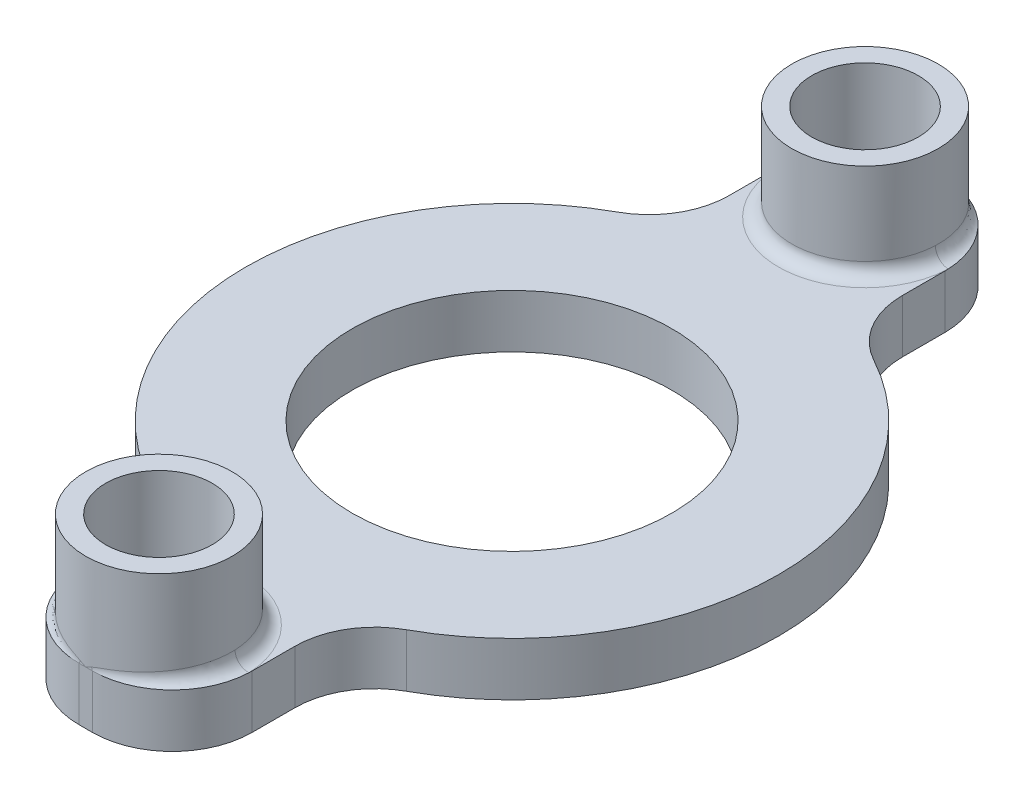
ISO-10303-21;
HEADER;
FILE_DESCRIPTION(('STEP AP214'),'2;1');
FILE_NAME('part.step','',(''),(''),'','','');
FILE_SCHEMA(('AUTOMOTIVE_DESIGN { 1 0 10303 214 1 1 1 1 }'));
ENDSEC;
DATA;
#1=APPLICATION_CONTEXT('core data for automotive mechanical design processes');
#2=APPLICATION_PROTOCOL_DEFINITION('international standard','automotive_design',2000,#1);
#3=PRODUCT_CONTEXT('',#1,'mechanical');
#4=PRODUCT('Part','Part','',(#3));
#5=PRODUCT_RELATED_PRODUCT_CATEGORY('part','',(#4));
#6=PRODUCT_DEFINITION_FORMATION('','',#4);
#7=PRODUCT_DEFINITION_CONTEXT('part definition',#1,'design');
#8=PRODUCT_DEFINITION('design','',#6,#7);
#9=PRODUCT_DEFINITION_SHAPE('','',#8);
#10=(LENGTH_UNIT() NAMED_UNIT(*) SI_UNIT(.MILLI.,.METRE.));
#11=(NAMED_UNIT(*) PLANE_ANGLE_UNIT() SI_UNIT($,.RADIAN.));
#12=(NAMED_UNIT(*) SI_UNIT($,.STERADIAN.) SOLID_ANGLE_UNIT());
#13=UNCERTAINTY_MEASURE_WITH_UNIT(LENGTH_MEASURE(1.E-05),#10,'distance_accuracy_value','');
#14=(GEOMETRIC_REPRESENTATION_CONTEXT(3) GLOBAL_UNCERTAINTY_ASSIGNED_CONTEXT((#13)) GLOBAL_UNIT_ASSIGNED_CONTEXT((#10,
#11,#12)) REPRESENTATION_CONTEXT('',''));
#15=CARTESIAN_POINT('',(0.,0.,0.));
#16=DIRECTION('',(0.,0.,1.));
#17=DIRECTION('',(1.,0.,0.));
#18=AXIS2_PLACEMENT_3D('',#15,#16,#17);
#19=CARTESIAN_POINT('',(0.,2.,0.));
#20=DIRECTION('',(0.,-1.,0.));
#21=DIRECTION('',(0.,0.,-1.));
#22=AXIS2_PLACEMENT_3D('',#19,#20,#21);
#23=CYLINDRICAL_SURFACE('',#22,10.);
#24=CARTESIAN_POINT('',(0.,2.,0.));
#25=DIRECTION('',(0.,1.,0.));
#26=DIRECTION('',(0.,0.,1.));
#27=AXIS2_PLACEMENT_3D('',#24,#25,#26);
#28=CIRCLE('',#27,10.);
#29=CARTESIAN_POINT('',(4.80769230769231,2.,8.76847162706));
#30=VERTEX_POINT('',#29);
#31=CARTESIAN_POINT('',(4.80769230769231,2.,-8.76847162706));
#32=VERTEX_POINT('',#31);
#33=EDGE_CURVE('E407',#30,#32,#28,.T.);
#34=ORIENTED_EDGE('',*,*,#33,.F.);
#35=DIRECTION('',(0.,-1.,0.));
#36=VECTOR('',#35,1.);
#37=CARTESIAN_POINT('',(4.80769230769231,2.,8.76847162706));
#38=LINE('',#37,#36);
#39=CARTESIAN_POINT('',(4.80769230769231,0.,8.76847162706));
#40=VERTEX_POINT('',#39);
#41=EDGE_CURVE('E437',#30,#40,#38,.T.);
#42=ORIENTED_EDGE('',*,*,#41,.T.);
#43=CARTESIAN_POINT('',(0.,0.,0.));
#44=DIRECTION('',(0.,1.,0.));
#45=DIRECTION('',(0.,0.,1.));
#46=AXIS2_PLACEMENT_3D('',#43,#44,#45);
#47=CIRCLE('',#46,10.);
#48=CARTESIAN_POINT('',(4.80769230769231,0.,-8.76847162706));
#49=VERTEX_POINT('',#48);
#50=EDGE_CURVE('E539',#40,#49,#47,.T.);
#51=ORIENTED_EDGE('',*,*,#50,.T.);
#52=DIRECTION('',(0.,-1.,0.));
#53=VECTOR('',#52,1.);
#54=CARTESIAN_POINT('',(4.80769230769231,2.,-8.76847162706));
#55=LINE('',#54,#53);
#56=EDGE_CURVE('E434',#49,#32,#55,.F.);
#57=ORIENTED_EDGE('',*,*,#56,.T.);
#58=EDGE_LOOP('',(#34,#42,#51,#57));
#59=FACE_BOUND('',#58,.T.);
#60=ADVANCED_FACE('F49',(#59),#23,.T.);
#61=CARTESIAN_POINT('',(3.25,2.,0.));
#62=DIRECTION('',(1.,0.,0.));
#63=DIRECTION('',(0.,0.,-1.));
#64=AXIS2_PLACEMENT_3D('',#61,#62,#63);
#65=PLANE('',#64);
#66=DIRECTION('',(0.,0.,1.));
#67=VECTOR('',#66,1.);
#68=CARTESIAN_POINT('',(3.25,2.,0.));
#69=LINE('',#68,#67);
#70=CARTESIAN_POINT('',(3.25,2.,-13.));
#71=VERTEX_POINT('',#70);
#72=CARTESIAN_POINT('',(3.25,2.,-11.399013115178));
#73=VERTEX_POINT('',#72);
#74=EDGE_CURVE('E522',#71,#73,#69,.T.);
#75=ORIENTED_EDGE('',*,*,#74,.T.);
#76=DIRECTION('',(0.,-1.,0.));
#77=VECTOR('',#76,1.);
#78=CARTESIAN_POINT('',(3.25,2.,-11.399013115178));
#79=LINE('',#78,#77);
#80=CARTESIAN_POINT('',(3.25,0.,-11.399013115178));
#81=VERTEX_POINT('',#80);
#82=EDGE_CURVE('E451',#73,#81,#79,.T.);
#83=ORIENTED_EDGE('',*,*,#82,.T.);
#84=DIRECTION('',(0.,0.,1.));
#85=VECTOR('',#84,1.);
#86=CARTESIAN_POINT('',(3.25,0.,0.));
#87=LINE('',#86,#85);
#88=CARTESIAN_POINT('',(3.25,0.,-13.));
#89=VERTEX_POINT('',#88);
#90=EDGE_CURVE('E540',#89,#81,#87,.T.);
#91=ORIENTED_EDGE('',*,*,#90,.F.);
#92=DIRECTION('',(0.,-1.,0.));
#93=VECTOR('',#92,1.);
#94=CARTESIAN_POINT('',(3.25,2.,-13.));
#95=LINE('',#94,#93);
#96=EDGE_CURVE('E448',#89,#71,#95,.F.);
#97=ORIENTED_EDGE('',*,*,#96,.T.);
#98=EDGE_LOOP('',(#75,#83,#91,#97));
#99=FACE_BOUND('',#98,.T.);
#100=ADVANCED_FACE('F368',(#99),#65,.T.);
#101=CARTESIAN_POINT('',(0.,2.,-16.));
#102=DIRECTION('',(0.,0.,-1.));
#103=DIRECTION('',(-1.,0.,0.));
#104=AXIS2_PLACEMENT_3D('',#101,#102,#103);
#105=PLANE('',#104);
#106=DIRECTION('',(1.,0.,0.));
#107=VECTOR('',#106,1.);
#108=CARTESIAN_POINT('',(0.,2.,-16.));
#109=LINE('',#108,#107);
#110=CARTESIAN_POINT('',(0.,2.,-16.));
#111=VERTEX_POINT('',#110);
#112=CARTESIAN_POINT('',(0.25,2.,-16.));
#113=VERTEX_POINT('',#112);
#114=EDGE_CURVE('E531',#111,#113,#109,.T.);
#115=ORIENTED_EDGE('',*,*,#114,.T.);
#116=DIRECTION('',(0.,-1.,0.));
#117=VECTOR('',#116,1.);
#118=CARTESIAN_POINT('',(0.25,2.,-16.));
#119=LINE('',#118,#117);
#120=CARTESIAN_POINT('',(0.25,0.,-16.));
#121=VERTEX_POINT('',#120);
#122=EDGE_CURVE('E458',#113,#121,#119,.T.);
#123=ORIENTED_EDGE('',*,*,#122,.T.);
#124=DIRECTION('',(1.,0.,0.));
#125=VECTOR('',#124,1.);
#126=CARTESIAN_POINT('',(0.,0.,-16.));
#127=LINE('',#126,#125);
#128=CARTESIAN_POINT('',(-0.25,0.,-16.));
#129=VERTEX_POINT('',#128);
#130=EDGE_CURVE('E548',#129,#121,#127,.T.);
#131=ORIENTED_EDGE('',*,*,#130,.F.);
#132=DIRECTION('',(0.,-1.,0.));
#133=VECTOR('',#132,1.);
#134=CARTESIAN_POINT('',(-0.25,2.,-16.));
#135=LINE('',#134,#133);
#136=CARTESIAN_POINT('',(-0.25,2.,-16.));
#137=VERTEX_POINT('',#136);
#138=EDGE_CURVE('E455',#129,#137,#135,.F.);
#139=ORIENTED_EDGE('',*,*,#138,.T.);
#140=EDGE_CURVE('E578',#137,#111,#109,.T.);
#141=ORIENTED_EDGE('',*,*,#140,.T.);
#142=EDGE_LOOP('',(#115,#123,#131,#139,#141));
#143=FACE_BOUND('',#142,.T.);
#144=ADVANCED_FACE('F376',(#143),#105,.T.);
#145=CARTESIAN_POINT('',(-3.25,2.,0.));
#146=DIRECTION('',(-1.,0.,0.));
#147=DIRECTION('',(0.,0.,1.));
#148=AXIS2_PLACEMENT_3D('',#145,#146,#147);
#149=PLANE('',#148);
#150=DIRECTION('',(0.,0.,-1.));
#151=VECTOR('',#150,1.);
#152=CARTESIAN_POINT('',(-3.25,0.,0.));
#153=LINE('',#152,#151);
#154=CARTESIAN_POINT('',(-3.25,0.,-11.399013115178));
#155=VERTEX_POINT('',#154);
#156=CARTESIAN_POINT('',(-3.25,0.,-13.));
#157=VERTEX_POINT('',#156);
#158=EDGE_CURVE('E556',#155,#157,#153,.T.);
#159=ORIENTED_EDGE('',*,*,#158,.F.);
#160=DIRECTION('',(0.,-1.,0.));
#161=VECTOR('',#160,1.);
#162=CARTESIAN_POINT('',(-3.25,2.,-11.399013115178));
#163=LINE('',#162,#161);
#164=CARTESIAN_POINT('',(-3.25,2.,-11.399013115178));
#165=VERTEX_POINT('',#164);
#166=EDGE_CURVE('E420',#155,#165,#163,.F.);
#167=ORIENTED_EDGE('',*,*,#166,.T.);
#168=DIRECTION('',(0.,0.,-1.));
#169=VECTOR('',#168,1.);
#170=CARTESIAN_POINT('',(-3.25,2.,0.));
#171=LINE('',#170,#169);
#172=CARTESIAN_POINT('',(-3.25,2.,-13.));
#173=VERTEX_POINT('',#172);
#174=EDGE_CURVE('E405',#165,#173,#171,.T.);
#175=ORIENTED_EDGE('',*,*,#174,.T.);
#176=DIRECTION('',(0.,-1.,0.));
#177=VECTOR('',#176,1.);
#178=CARTESIAN_POINT('',(-3.25,2.,-13.));
#179=LINE('',#178,#177);
#180=EDGE_CURVE('E415',#173,#157,#179,.T.);
#181=ORIENTED_EDGE('',*,*,#180,.T.);
#182=EDGE_LOOP('',(#159,#167,#175,#181));
#183=FACE_BOUND('',#182,.T.);
#184=ADVANCED_FACE('F384',(#183),#149,.T.);
#185=CARTESIAN_POINT('',(-4.80769230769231,2.,-8.76847162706));
#186=VERTEX_POINT('',#185);
#187=CARTESIAN_POINT('',(-4.80769230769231,2.,8.76847162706));
#188=VERTEX_POINT('',#187);
#189=EDGE_CURVE('E395',#186,#188,#28,.T.);
#190=ORIENTED_EDGE('',*,*,#189,.F.);
#191=DIRECTION('',(0.,-1.,0.));
#192=VECTOR('',#191,1.);
#193=CARTESIAN_POINT('',(-4.80769230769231,2.,-8.76847162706));
#194=LINE('',#193,#192);
#195=CARTESIAN_POINT('',(-4.80769230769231,0.,-8.76847162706));
#196=VERTEX_POINT('',#195);
#197=EDGE_CURVE('E398',#186,#196,#194,.T.);
#198=ORIENTED_EDGE('',*,*,#197,.T.);
#199=CARTESIAN_POINT('',(-4.80769230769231,0.,8.76847162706));
#200=VERTEX_POINT('',#199);
#201=EDGE_CURVE('E545',#196,#200,#47,.T.);
#202=ORIENTED_EDGE('',*,*,#201,.T.);
#203=DIRECTION('',(0.,-1.,0.));
#204=VECTOR('',#203,1.);
#205=CARTESIAN_POINT('',(-4.80769230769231,2.,8.76847162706));
#206=LINE('',#205,#204);
#207=EDGE_CURVE('E401',#200,#188,#206,.F.);
#208=ORIENTED_EDGE('',*,*,#207,.T.);
#209=EDGE_LOOP('',(#190,#198,#202,#208));
#210=FACE_BOUND('',#209,.T.);
#211=ADVANCED_FACE('F371',(#210),#23,.T.);
#212=CARTESIAN_POINT('',(-3.25,2.,0.));
#213=DIRECTION('',(1.,0.,0.));
#214=DIRECTION('',(0.,0.,-1.));
#215=AXIS2_PLACEMENT_3D('',#212,#213,#214);
#216=PLANE('',#215);
#217=DIRECTION('',(0.,0.,1.));
#218=VECTOR('',#217,1.);
#219=CARTESIAN_POINT('',(-3.25,2.,0.));
#220=LINE('',#219,#218);
#221=CARTESIAN_POINT('',(-3.25,2.,11.399013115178));
#222=VERTEX_POINT('',#221);
#223=CARTESIAN_POINT('',(-3.25,2.,13.));
#224=VERTEX_POINT('',#223);
#225=EDGE_CURVE('E239',#222,#224,#220,.T.);
#226=ORIENTED_EDGE('',*,*,#225,.F.);
#227=DIRECTION('',(0.,1.,0.));
#228=VECTOR('',#227,1.);
#229=CARTESIAN_POINT('',(-3.25,0.,11.399013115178));
#230=LINE('',#229,#228);
#231=CARTESIAN_POINT('',(-3.25,0.,11.399013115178));
#232=VERTEX_POINT('',#231);
#233=EDGE_CURVE('E430',#222,#232,#230,.F.);
#234=ORIENTED_EDGE('',*,*,#233,.T.);
#235=DIRECTION('',(0.,0.,1.));
#236=VECTOR('',#235,1.);
#237=CARTESIAN_POINT('',(-3.25,0.,0.));
#238=LINE('',#237,#236);
#239=CARTESIAN_POINT('',(-3.25,0.,13.));
#240=VERTEX_POINT('',#239);
#241=EDGE_CURVE('E555',#232,#240,#238,.T.);
#242=ORIENTED_EDGE('',*,*,#241,.T.);
#243=DIRECTION('',(0.,-1.,0.));
#244=VECTOR('',#243,1.);
#245=CARTESIAN_POINT('',(-3.25,2.,13.));
#246=LINE('',#245,#244);
#247=EDGE_CURVE('E427',#240,#224,#246,.F.);
#248=ORIENTED_EDGE('',*,*,#247,.T.);
#249=EDGE_LOOP('',(#226,#234,#242,#248));
#250=FACE_BOUND('',#249,.T.);
#251=ADVANCED_FACE('F383',(#250),#216,.F.);
#252=CARTESIAN_POINT('',(0.,2.,16.));
#253=DIRECTION('',(0.,0.,-1.));
#254=DIRECTION('',(-1.,0.,0.));
#255=AXIS2_PLACEMENT_3D('',#252,#253,#254);
#256=PLANE('',#255);
#257=DIRECTION('',(1.,0.,0.));
#258=VECTOR('',#257,1.);
#259=CARTESIAN_POINT('',(0.,2.,16.));
#260=LINE('',#259,#258);
#261=CARTESIAN_POINT('',(-0.25,2.,16.));
#262=VERTEX_POINT('',#261);
#263=CARTESIAN_POINT('',(0.,2.,16.));
#264=VERTEX_POINT('',#263);
#265=EDGE_CURVE('E230',#262,#264,#260,.T.);
#266=ORIENTED_EDGE('',*,*,#265,.F.);
#267=DIRECTION('',(0.,-1.,0.));
#268=VECTOR('',#267,1.);
#269=CARTESIAN_POINT('',(-0.25,2.,16.));
#270=LINE('',#269,#268);
#271=CARTESIAN_POINT('',(-0.25,0.,16.));
#272=VERTEX_POINT('',#271);
#273=EDGE_CURVE('E496',#262,#272,#270,.T.);
#274=ORIENTED_EDGE('',*,*,#273,.T.);
#275=DIRECTION('',(1.,0.,0.));
#276=VECTOR('',#275,1.);
#277=CARTESIAN_POINT('',(0.,0.,16.));
#278=LINE('',#277,#276);
#279=CARTESIAN_POINT('',(0.25,0.,16.));
#280=VERTEX_POINT('',#279);
#281=EDGE_CURVE('E560',#272,#280,#278,.T.);
#282=ORIENTED_EDGE('',*,*,#281,.T.);
#283=DIRECTION('',(0.,-1.,0.));
#284=VECTOR('',#283,1.);
#285=CARTESIAN_POINT('',(0.25,2.,16.));
#286=LINE('',#285,#284);
#287=CARTESIAN_POINT('',(0.25,2.,16.));
#288=VERTEX_POINT('',#287);
#289=EDGE_CURVE('E234',#280,#288,#286,.F.);
#290=ORIENTED_EDGE('',*,*,#289,.T.);
#291=EDGE_CURVE('E227',#264,#288,#260,.T.);
#292=ORIENTED_EDGE('',*,*,#291,.F.);
#293=EDGE_LOOP('',(#266,#274,#282,#290,#292));
#294=FACE_BOUND('',#293,.T.);
#295=ADVANCED_FACE('F228',(#294),#256,.F.);
#296=CARTESIAN_POINT('',(3.25,2.,0.));
#297=DIRECTION('',(-1.,0.,0.));
#298=DIRECTION('',(0.,0.,1.));
#299=AXIS2_PLACEMENT_3D('',#296,#297,#298);
#300=PLANE('',#299);
#301=DIRECTION('',(0.,0.,-1.));
#302=VECTOR('',#301,1.);
#303=CARTESIAN_POINT('',(3.25,0.,0.));
#304=LINE('',#303,#302);
#305=CARTESIAN_POINT('',(3.25,0.,13.));
#306=VERTEX_POINT('',#305);
#307=CARTESIAN_POINT('',(3.25,0.,11.399013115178));
#308=VERTEX_POINT('',#307);
#309=EDGE_CURVE('E569',#306,#308,#304,.T.);
#310=ORIENTED_EDGE('',*,*,#309,.T.);
#311=DIRECTION('',(0.,1.,0.));
#312=VECTOR('',#311,1.);
#313=CARTESIAN_POINT('',(3.25,2.,11.399013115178));
#314=LINE('',#313,#312);
#315=CARTESIAN_POINT('',(3.25,2.,11.399013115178));
#316=VERTEX_POINT('',#315);
#317=EDGE_CURVE('E445',#308,#316,#314,.T.);
#318=ORIENTED_EDGE('',*,*,#317,.T.);
#319=DIRECTION('',(0.,0.,-1.));
#320=VECTOR('',#319,1.);
#321=CARTESIAN_POINT('',(3.25,2.,0.));
#322=LINE('',#321,#320);
#323=CARTESIAN_POINT('',(3.25,2.,13.));
#324=VERTEX_POINT('',#323);
#325=EDGE_CURVE('E245',#324,#316,#322,.T.);
#326=ORIENTED_EDGE('',*,*,#325,.F.);
#327=DIRECTION('',(0.,-1.,0.));
#328=VECTOR('',#327,1.);
#329=CARTESIAN_POINT('',(3.25,2.,13.));
#330=LINE('',#329,#328);
#331=EDGE_CURVE('E441',#324,#306,#330,.T.);
#332=ORIENTED_EDGE('',*,*,#331,.T.);
#333=EDGE_LOOP('',(#310,#318,#326,#332));
#334=FACE_BOUND('',#333,.T.);
#335=ADVANCED_FACE('F626',(#334),#300,.F.);
#336=CARTESIAN_POINT('',(0.,2.,0.));
#337=DIRECTION('',(0.,1.,0.));
#338=DIRECTION('',(0.,0.,1.));
#339=AXIS2_PLACEMENT_3D('',#336,#337,#338);
#340=PLANE('',#339);
#341=CARTESIAN_POINT('',(0.,2.,0.));
#342=DIRECTION('',(0.,1.,0.));
#343=DIRECTION('',(0.,0.,1.));
#344=AXIS2_PLACEMENT_3D('',#341,#342,#343);
#345=CIRCLE('',#344,6.);
#346=CARTESIAN_POINT('',(0.,2.,6.));
#347=VERTEX_POINT('',#346);
#348=EDGE_CURVE('E551',#347,#347,#345,.T.);
#349=ORIENTED_EDGE('',*,*,#348,.F.);
#350=EDGE_LOOP('',(#349));
#351=FACE_BOUND('',#350,.T.);
#352=CARTESIAN_POINT('',(-0.25,2.,13.));
#353=DIRECTION('',(0.,1.,0.));
#354=DIRECTION('',(0.,0.,1.));
#355=AXIS2_PLACEMENT_3D('',#352,#353,#354);
#356=CIRCLE('',#355,3.);
#357=CARTESIAN_POINT('',(-3.24749799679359,2.,13.1224979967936));
#358=VERTEX_POINT('',#357);
#359=EDGE_CURVE('E480',#224,#358,#356,.T.);
#360=ORIENTED_EDGE('',*,*,#359,.T.);
#361=CARTESIAN_POINT('',(0.,2.,13.25));
#362=DIRECTION('',(0.,1.,0.));
#363=DIRECTION('',(0.,0.,1.));
#364=AXIS2_PLACEMENT_3D('',#361,#362,#363);
#365=CIRCLE('',#364,3.25);
#366=CARTESIAN_POINT('',(3.24749799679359,2.,13.1224979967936));
#367=VERTEX_POINT('',#366);
#368=EDGE_CURVE('E255',#358,#367,#365,.F.);
#369=ORIENTED_EDGE('',*,*,#368,.T.);
#370=CARTESIAN_POINT('',(0.25,2.,13.));
#371=DIRECTION('',(0.,1.,0.));
#372=DIRECTION('',(0.,0.,1.));
#373=AXIS2_PLACEMENT_3D('',#370,#371,#372);
#374=CIRCLE('',#373,3.);
#375=EDGE_CURVE('E474',#367,#324,#374,.T.);
#376=ORIENTED_EDGE('',*,*,#375,.T.);
#377=ORIENTED_EDGE('',*,*,#325,.T.);
#378=CARTESIAN_POINT('',(6.25,2.,11.399013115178));
#379=DIRECTION('',(0.,1.,0.));
#380=DIRECTION('',(0.,0.,1.));
#381=AXIS2_PLACEMENT_3D('',#378,#379,#380);
#382=CIRCLE('',#381,3.);
#383=EDGE_CURVE('E512',#316,#30,#382,.F.);
#384=ORIENTED_EDGE('',*,*,#383,.T.);
#385=ORIENTED_EDGE('',*,*,#33,.T.);
#386=CARTESIAN_POINT('',(6.25,2.,-11.399013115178));
#387=DIRECTION('',(0.,1.,0.));
#388=DIRECTION('',(0.,0.,1.));
#389=AXIS2_PLACEMENT_3D('',#386,#387,#388);
#390=CIRCLE('',#389,3.);
#391=EDGE_CURVE('E223',#32,#73,#390,.F.);
#392=ORIENTED_EDGE('',*,*,#391,.T.);
#393=ORIENTED_EDGE('',*,*,#74,.F.);
#394=CARTESIAN_POINT('',(0.25,2.,-13.));
#395=DIRECTION('',(0.,1.,0.));
#396=DIRECTION('',(0.,0.,1.));
#397=AXIS2_PLACEMENT_3D('',#394,#395,#396);
#398=CIRCLE('',#397,3.);
#399=CARTESIAN_POINT('',(3.24749799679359,2.,-13.1224979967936));
#400=VERTEX_POINT('',#399);
#401=EDGE_CURVE('E490',#71,#400,#398,.T.);
#402=ORIENTED_EDGE('',*,*,#401,.T.);
#403=CARTESIAN_POINT('',(0.,2.,-13.25));
#404=DIRECTION('',(0.,1.,0.));
#405=DIRECTION('',(0.,0.,1.));
#406=AXIS2_PLACEMENT_3D('',#403,#404,#405);
#407=CIRCLE('',#406,3.25);
#408=CARTESIAN_POINT('',(-3.24749799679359,2.,-13.1224979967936));
#409=VERTEX_POINT('',#408);
#410=EDGE_CURVE('E250',#400,#409,#407,.F.);
#411=ORIENTED_EDGE('',*,*,#410,.T.);
#412=CARTESIAN_POINT('',(-0.25,2.,-13.));
#413=DIRECTION('',(0.,1.,0.));
#414=DIRECTION('',(0.,0.,1.));
#415=AXIS2_PLACEMENT_3D('',#412,#413,#414);
#416=CIRCLE('',#415,3.);
#417=EDGE_CURVE('E484',#409,#173,#416,.T.);
#418=ORIENTED_EDGE('',*,*,#417,.T.);
#419=ORIENTED_EDGE('',*,*,#174,.F.);
#420=CARTESIAN_POINT('',(-6.25,2.,-11.399013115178));
#421=DIRECTION('',(0.,1.,0.));
#422=DIRECTION('',(0.,0.,1.));
#423=AXIS2_PLACEMENT_3D('',#420,#421,#422);
#424=CIRCLE('',#423,3.);
#425=EDGE_CURVE('E412',#165,#186,#424,.F.);
#426=ORIENTED_EDGE('',*,*,#425,.T.);
#427=ORIENTED_EDGE('',*,*,#189,.T.);
#428=CARTESIAN_POINT('',(-6.25,2.,11.399013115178));
#429=DIRECTION('',(0.,1.,0.));
#430=DIRECTION('',(0.,0.,1.));
#431=AXIS2_PLACEMENT_3D('',#428,#429,#430);
#432=CIRCLE('',#431,3.);
#433=EDGE_CURVE('E506',#188,#222,#432,.F.);
#434=ORIENTED_EDGE('',*,*,#433,.T.);
#435=ORIENTED_EDGE('',*,*,#225,.T.);
#436=EDGE_LOOP('',(#360,#369,#376,#377,#384,#385,#392,#393,#402,#411,#418,#419,#426,#427,#434,#435));
#437=FACE_BOUND('',#436,.T.);
#438=ADVANCED_FACE('F342',(#351,#437),#340,.T.);
#439=CARTESIAN_POINT('',(0.,0.,0.));
#440=DIRECTION('',(0.,1.,0.));
#441=DIRECTION('',(0.,0.,1.));
#442=AXIS2_PLACEMENT_3D('',#439,#440,#441);
#443=PLANE('',#442);
#444=CARTESIAN_POINT('',(0.,0.,-13.25));
#445=DIRECTION('',(0.,1.,0.));
#446=DIRECTION('',(0.,0.,1.));
#447=AXIS2_PLACEMENT_3D('',#444,#445,#446);
#448=CIRCLE('',#447,2.);
#449=CARTESIAN_POINT('',(0.,0.,-11.25));
#450=VERTEX_POINT('',#449);
#451=EDGE_CURVE('E782',#450,#450,#448,.T.);
#452=ORIENTED_EDGE('',*,*,#451,.T.);
#453=EDGE_LOOP('',(#452));
#454=FACE_BOUND('',#453,.T.);
#455=CARTESIAN_POINT('',(0.,0.,13.25));
#456=DIRECTION('',(0.,1.,0.));
#457=DIRECTION('',(0.,0.,1.));
#458=AXIS2_PLACEMENT_3D('',#455,#456,#457);
#459=CIRCLE('',#458,2.);
#460=CARTESIAN_POINT('',(0.,0.,15.25));
#461=VERTEX_POINT('',#460);
#462=EDGE_CURVE('E759',#461,#461,#459,.T.);
#463=ORIENTED_EDGE('',*,*,#462,.T.);
#464=EDGE_LOOP('',(#463));
#465=FACE_BOUND('',#464,.T.);
#466=CARTESIAN_POINT('',(0.,0.,0.));
#467=DIRECTION('',(0.,1.,0.));
#468=DIRECTION('',(0.,0.,1.));
#469=AXIS2_PLACEMENT_3D('',#466,#467,#468);
#470=CIRCLE('',#469,6.);
#471=CARTESIAN_POINT('',(0.,0.,6.));
#472=VERTEX_POINT('',#471);
#473=EDGE_CURVE('E543',#472,#472,#470,.T.);
#474=ORIENTED_EDGE('',*,*,#473,.T.);
#475=EDGE_LOOP('',(#474));
#476=FACE_BOUND('',#475,.T.);
#477=ORIENTED_EDGE('',*,*,#130,.T.);
#478=CARTESIAN_POINT('',(0.25,0.,-13.));
#479=DIRECTION('',(0.,1.,0.));
#480=DIRECTION('',(0.,0.,1.));
#481=AXIS2_PLACEMENT_3D('',#478,#479,#480);
#482=CIRCLE('',#481,3.);
#483=EDGE_CURVE('E471',#121,#89,#482,.F.);
#484=ORIENTED_EDGE('',*,*,#483,.T.);
#485=ORIENTED_EDGE('',*,*,#90,.T.);
#486=CARTESIAN_POINT('',(6.25,0.,-11.399013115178));
#487=DIRECTION('',(0.,1.,0.));
#488=DIRECTION('',(0.,0.,1.));
#489=AXIS2_PLACEMENT_3D('',#486,#487,#488);
#490=CIRCLE('',#489,3.);
#491=EDGE_CURVE('E515',#81,#49,#490,.T.);
#492=ORIENTED_EDGE('',*,*,#491,.T.);
#493=ORIENTED_EDGE('',*,*,#50,.F.);
#494=CARTESIAN_POINT('',(6.25,0.,11.399013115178));
#495=DIRECTION('',(0.,1.,0.));
#496=DIRECTION('',(0.,0.,1.));
#497=AXIS2_PLACEMENT_3D('',#494,#495,#496);
#498=CIRCLE('',#497,3.);
#499=EDGE_CURVE('E509',#40,#308,#498,.T.);
#500=ORIENTED_EDGE('',*,*,#499,.T.);
#501=ORIENTED_EDGE('',*,*,#309,.F.);
#502=CARTESIAN_POINT('',(0.25,0.,13.));
#503=DIRECTION('',(0.,1.,0.));
#504=DIRECTION('',(0.,0.,1.));
#505=AXIS2_PLACEMENT_3D('',#502,#503,#504);
#506=CIRCLE('',#505,3.);
#507=EDGE_CURVE('E462',#306,#280,#506,.F.);
#508=ORIENTED_EDGE('',*,*,#507,.T.);
#509=ORIENTED_EDGE('',*,*,#281,.F.);
#510=CARTESIAN_POINT('',(-0.25,0.,13.));
#511=DIRECTION('',(0.,1.,0.));
#512=DIRECTION('',(0.,0.,1.));
#513=AXIS2_PLACEMENT_3D('',#510,#511,#512);
#514=CIRCLE('',#513,3.);
#515=EDGE_CURVE('E465',#272,#240,#514,.F.);
#516=ORIENTED_EDGE('',*,*,#515,.T.);
#517=ORIENTED_EDGE('',*,*,#241,.F.);
#518=CARTESIAN_POINT('',(-6.25,0.,11.399013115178));
#519=DIRECTION('',(0.,1.,0.));
#520=DIRECTION('',(0.,0.,1.));
#521=AXIS2_PLACEMENT_3D('',#518,#519,#520);
#522=CIRCLE('',#521,3.);
#523=EDGE_CURVE('E503',#232,#200,#522,.T.);
#524=ORIENTED_EDGE('',*,*,#523,.T.);
#525=ORIENTED_EDGE('',*,*,#201,.F.);
#526=CARTESIAN_POINT('',(-6.25,0.,-11.399013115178));
#527=DIRECTION('',(0.,1.,0.));
#528=DIRECTION('',(0.,0.,1.));
#529=AXIS2_PLACEMENT_3D('',#526,#527,#528);
#530=CIRCLE('',#529,3.);
#531=EDGE_CURVE('E413',#196,#155,#530,.T.);
#532=ORIENTED_EDGE('',*,*,#531,.T.);
#533=ORIENTED_EDGE('',*,*,#158,.T.);
#534=CARTESIAN_POINT('',(-0.25,0.,-13.));
#535=DIRECTION('',(0.,1.,0.));
#536=DIRECTION('',(0.,0.,1.));
#537=AXIS2_PLACEMENT_3D('',#534,#535,#536);
#538=CIRCLE('',#537,3.);
#539=EDGE_CURVE('E468',#157,#129,#538,.F.);
#540=ORIENTED_EDGE('',*,*,#539,.T.);
#541=EDGE_LOOP('',(#477,#484,#485,#492,#493,#500,#501,#508,#509,#516,#517,#524,#525,#532,#533,#540));
#542=FACE_BOUND('',#541,.T.);
#543=ADVANCED_FACE('F538',(#454,#465,#476,#542),#443,.F.);
#544=CARTESIAN_POINT('',(0.,0.,0.));
#545=DIRECTION('',(0.,1.,0.));
#546=DIRECTION('',(0.,0.,1.));
#547=AXIS2_PLACEMENT_3D('',#544,#545,#546);
#548=CYLINDRICAL_SURFACE('',#547,6.);
#549=ORIENTED_EDGE('',*,*,#473,.F.);
#550=EDGE_LOOP('',(#549));
#551=FACE_BOUND('',#550,.T.);
#552=ORIENTED_EDGE('',*,*,#348,.T.);
#553=EDGE_LOOP('',(#552));
#554=FACE_BOUND('',#553,.T.);
#555=ADVANCED_FACE('F280',(#551,#554),#548,.F.);
#556=CARTESIAN_POINT('',(0.,5.6,13.25));
#557=DIRECTION('',(0.,-1.,0.));
#558=DIRECTION('',(0.,0.,-1.));
#559=AXIS2_PLACEMENT_3D('',#556,#557,#558);
#560=CYLINDRICAL_SURFACE('',#559,2.75);
#561=CARTESIAN_POINT('',(0.,5.6,13.25));
#562=DIRECTION('',(0.,1.,0.));
#563=DIRECTION('',(0.,0.,1.));
#564=AXIS2_PLACEMENT_3D('',#561,#562,#563);
#565=CIRCLE('',#564,2.75);
#566=CARTESIAN_POINT('',(0.,5.6,16.));
#567=VERTEX_POINT('',#566);
#568=EDGE_CURVE('E781',#567,#567,#565,.T.);
#569=ORIENTED_EDGE('',*,*,#568,.F.);
#570=EDGE_LOOP('',(#569));
#571=FACE_BOUND('',#570,.T.);
#572=CARTESIAN_POINT('',(-0.926345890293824,2.39225269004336,15.8392823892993));
#573=CARTESIAN_POINT('',(-0.988434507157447,2.1445997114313,15.8170694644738));
#574=CARTESIAN_POINT('',(-1.09477241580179,2.,16.));
#575=CARTESIAN_POINT('',(-0.850532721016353,2.36683058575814,15.866391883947));
#576=CARTESIAN_POINT('',(-0.913512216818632,2.14568845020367,15.8460933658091));
#577=CARTESIAN_POINT('',(-1.00517503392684,2.,16.));
#578=CARTESIAN_POINT('',(-0.774231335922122,2.33854612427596,15.8899481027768));
#579=CARTESIAN_POINT('',(-0.834164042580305,2.1413741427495,15.8725751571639));
#580=CARTESIAN_POINT('',(-0.915000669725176,2.,16.));
#581=CARTESIAN_POINT('',(-0.620990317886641,2.2779231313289,15.9301417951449));
#582=CARTESIAN_POINT('',(-0.673096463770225,2.12538586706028,15.9180840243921));
#583=CARTESIAN_POINT('',(-0.733897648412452,2.,16.));
#584=CARTESIAN_POINT('',(-0.544050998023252,2.24558648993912,15.9467824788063));
#585=CARTESIAN_POINT('',(-0.590648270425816,2.11384634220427,15.9375528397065));
#586=CARTESIAN_POINT('',(-0.642969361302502,2.,16.));
#587=CARTESIAN_POINT('',(-0.390824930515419,2.1789482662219,15.9731813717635));
#588=CARTESIAN_POINT('',(-0.425903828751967,2.08658500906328,15.9683010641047));
#589=CARTESIAN_POINT('',(-0.461884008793,2.,16.));
#590=CARTESIAN_POINT('',(-0.31454307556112,2.14467846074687,15.9830279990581));
#591=CARTESIAN_POINT('',(-0.342910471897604,2.07087819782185,15.9799634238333));
#592=CARTESIAN_POINT('',(-0.371732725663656,2.,16.));
#593=CARTESIAN_POINT('',(-0.161824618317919,2.07499434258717,15.9963035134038));
#594=CARTESIAN_POINT('',(-0.176903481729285,2.03754544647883,15.9955854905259));
#595=CARTESIAN_POINT('',(-0.191247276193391,2.,16.));
#596=CARTESIAN_POINT('',(-0.0853881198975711,2.0395806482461,15.9997358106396));
#597=CARTESIAN_POINT('',(-0.0931644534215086,2.01979220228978,15.9996872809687));
#598=CARTESIAN_POINT('',(-0.100913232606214,2.,16.));
#599=CARTESIAN_POINT('',(-0.00748465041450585,2.00346947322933,15.9999902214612));
#600=CARTESIAN_POINT('',(-0.00816506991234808,2.00173471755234,15.9999884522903));
#601=CARTESIAN_POINT('',(-0.00884549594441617,2.,16.));
#602=CARTESIAN_POINT('',(-0.00598784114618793,2.00277563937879,15.9999938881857));
#603=CARTESIAN_POINT('',(-0.00653218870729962,2.00138781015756,15.9999927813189));
#604=CARTESIAN_POINT('',(-0.00707653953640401,2.,16.));
#605=CARTESIAN_POINT('',(-0.00299402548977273,2.00138787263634,15.999998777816));
#606=CARTESIAN_POINT('',(-0.00326621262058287,2.0006939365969,15.9999985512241));
#607=CARTESIAN_POINT('',(-0.00353839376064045,2.,16.));
#608=CARTESIAN_POINT('',(-0.00149701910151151,2.00069393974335,16.0000000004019));
#609=CARTESIAN_POINT('',(-0.00163311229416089,2.00034696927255,15.9999999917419));
#610=CARTESIAN_POINT('',(-0.0017692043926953,2.,16.));
#611=CARTESIAN_POINT('',(0.,2.,16.));
#612=CARTESIAN_POINT('',(0.,2.,16.));
#613=CARTESIAN_POINT('',(0.,2.,16.));
#614=(BOUNDED_SURFACE() B_SPLINE_SURFACE(3,2,((#572,#573,#574),(#575,#576,#577),(#578,#579,
#580),(#581,#582,#583),(#584,#585,#586),(#587,#588,#589),(#590,#591,#592),(#593,#594,#595),
(#596,#597,#598),(#599,#600,#601),(#602,#603,#604),(#605,#606,#607),(#608,#609,#610),(#611,#612,
#613)),.UNSPECIFIED.,.F.,.F.,.F.) B_SPLINE_SURFACE_WITH_KNOTS((4,2,2,2,2,2,4),(3,3),(0.,
0.295196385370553,0.590255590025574,0.881398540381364,1.17238666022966,1.17808717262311,
1.18378843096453),(0.,1.),
.UNSPECIFIED.) GEOMETRIC_REPRESENTATION_ITEM() RATIONAL_B_SPLINE_SURFACE(((1.,0.889910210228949,
1.),(1.,0.908569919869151,1.),(1.,0.924741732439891,1.),(1.,0.952289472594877,1.),(1.,
0.963667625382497,1.),(1.,0.981704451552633,1.),(1.,0.988423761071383,1.),(1.,0.997480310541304,
1.),(1.,0.999819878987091,1.),(1.,0.999993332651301,1.),(1.,0.99999583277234,1.),(1.,
0.999999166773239,1.),(1.,1.00000000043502,1.),(1.,1.,1.))) REPRESENTATION_ITEM('') SURFACE());
#615=CARTESIAN_POINT('',(-0.926345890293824,2.39225269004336,15.8392823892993));
#616=CARTESIAN_POINT('',(-0.850532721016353,2.36683058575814,15.866391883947));
#617=CARTESIAN_POINT('',(-0.774231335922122,2.33854612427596,15.8899481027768));
#618=CARTESIAN_POINT('',(-0.620990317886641,2.2779231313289,15.9301417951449));
#619=CARTESIAN_POINT('',(-0.544050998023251,2.24558648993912,15.9467824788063));
#620=CARTESIAN_POINT('',(-0.390824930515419,2.1789482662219,15.9731813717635));
#621=CARTESIAN_POINT('',(-0.314543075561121,2.14467846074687,15.9830279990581));
#622=CARTESIAN_POINT('',(-0.161824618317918,2.07499434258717,15.9963035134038));
#623=CARTESIAN_POINT('',(-0.0853881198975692,2.0395806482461,15.9997358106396));
#624=CARTESIAN_POINT('',(-0.00748465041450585,2.00346947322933,15.9999902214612));
#625=CARTESIAN_POINT('',(-0.00598784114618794,2.00277563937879,15.9999938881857));
#626=CARTESIAN_POINT('',(-0.00299402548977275,2.00138787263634,15.999998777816));
#627=CARTESIAN_POINT('',(-0.00149701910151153,2.00069393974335,16.0000000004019));
#628=CARTESIAN_POINT('',(0.,2.,16.));
#629=B_SPLINE_CURVE_WITH_KNOTS('',3,(#615,#616,#617,#618,#619,#620,#621,#622,#623,#624,#625,
#626,#627,#628),.UNSPECIFIED.,.F.,.F.,(4,2,2,2,2,2,4),(0.,0.295196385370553,0.590255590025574,
0.881398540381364,1.17238666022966,1.17808717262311,1.18378843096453),.UNSPECIFIED.);
#630=CARTESIAN_POINT('',(-0.21153846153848,2.09765715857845,15.9918518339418));
#631=VERTEX_POINT('',#630);
#632=EDGE_CURVE('E211',#631,#264,#629,.T.);
#633=ORIENTED_EDGE('',*,*,#632,.T.);
#634=CARTESIAN_POINT('',(1.09477241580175,2.,16.));
#635=CARTESIAN_POINT('',(0.988434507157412,2.1445997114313,15.8170694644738));
#636=CARTESIAN_POINT('',(0.926345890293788,2.39225269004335,15.8392823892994));
#637=CARTESIAN_POINT('',(1.00517503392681,2.,16.));
#638=CARTESIAN_POINT('',(0.913512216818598,2.14568845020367,15.8460933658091));
#639=CARTESIAN_POINT('',(0.85053272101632,2.36683058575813,15.866391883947));
#640=CARTESIAN_POINT('',(0.915000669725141,2.,16.));
#641=CARTESIAN_POINT('',(0.834164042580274,2.1413741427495,15.8725751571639));
#642=CARTESIAN_POINT('',(0.774231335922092,2.33854612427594,15.8899481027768));
#643=CARTESIAN_POINT('',(0.733897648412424,2.,16.));
#644=CARTESIAN_POINT('',(0.6730964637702,2.12538586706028,15.9180840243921));
#645=CARTESIAN_POINT('',(0.620990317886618,2.27792313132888,15.9301417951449));
#646=CARTESIAN_POINT('',(0.642969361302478,2.,16.));
#647=CARTESIAN_POINT('',(0.590648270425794,2.11384634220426,15.9375528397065));
#648=CARTESIAN_POINT('',(0.544050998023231,2.2455864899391,15.9467824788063));
#649=CARTESIAN_POINT('',(0.461884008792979,2.,16.));
#650=CARTESIAN_POINT('',(0.425903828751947,2.08658500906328,15.9683010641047));
#651=CARTESIAN_POINT('',(0.390824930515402,2.1789482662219,15.9731813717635));
#652=CARTESIAN_POINT('',(0.371732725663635,2.,16.));
#653=CARTESIAN_POINT('',(0.342910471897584,2.07087819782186,15.9799634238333));
#654=CARTESIAN_POINT('',(0.314543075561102,2.14467846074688,15.9830279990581));
#655=CARTESIAN_POINT('',(0.191247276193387,2.,16.));
#656=CARTESIAN_POINT('',(0.176903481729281,2.03754544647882,15.9955854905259));
#657=CARTESIAN_POINT('',(0.161824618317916,2.07499434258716,15.9963035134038));
#658=CARTESIAN_POINT('',(0.100913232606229,2.,16.));
#659=CARTESIAN_POINT('',(0.093164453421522,2.01979220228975,15.9996872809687));
#660=CARTESIAN_POINT('',(0.0853881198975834,2.03958064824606,15.9997358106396));
#661=CARTESIAN_POINT('',(0.00884549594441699,2.,16.));
#662=CARTESIAN_POINT('',(0.00816506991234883,2.00173471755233,15.9999884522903));
#663=CARTESIAN_POINT('',(0.00748465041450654,2.00346947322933,15.9999902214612));
#664=CARTESIAN_POINT('',(0.00707653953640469,2.,16.));
#665=CARTESIAN_POINT('',(0.00653218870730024,2.00138781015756,15.9999927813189));
#666=CARTESIAN_POINT('',(0.0059878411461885,2.00277563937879,15.9999938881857));
#667=CARTESIAN_POINT('',(0.00353839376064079,2.,16.));
#668=CARTESIAN_POINT('',(0.00326621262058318,2.0006939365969,15.9999985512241));
#669=CARTESIAN_POINT('',(0.00299402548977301,2.00138787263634,15.999998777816));
#670=CARTESIAN_POINT('',(0.00176920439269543,2.,16.));
#671=CARTESIAN_POINT('',(0.00163311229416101,2.00034696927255,15.9999999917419));
#672=CARTESIAN_POINT('',(0.00149701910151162,2.00069393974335,16.0000000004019));
#673=CARTESIAN_POINT('',(0.,2.,16.));
#674=CARTESIAN_POINT('',(0.,2.,16.));
#675=CARTESIAN_POINT('',(0.,2.,16.));
#676=(BOUNDED_SURFACE() B_SPLINE_SURFACE(3,2,((#634,#635,#636),(#637,#638,#639),(#640,#641,
#642),(#643,#644,#645),(#646,#647,#648),(#649,#650,#651),(#652,#653,#654),(#655,#656,#657),
(#658,#659,#660),(#661,#662,#663),(#664,#665,#666),(#667,#668,#669),(#670,#671,#672),(#673,#674,
#675)),.UNSPECIFIED.,.F.,.F.,.F.) B_SPLINE_SURFACE_WITH_KNOTS((4,2,2,2,2,2,4),(3,3),(0.,
0.295196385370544,0.590255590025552,0.88139854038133,1.17238666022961,1.17808717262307,
1.18378843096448),(0.,1.),
.UNSPECIFIED.) GEOMETRIC_REPRESENTATION_ITEM() RATIONAL_B_SPLINE_SURFACE(((1.,0.889910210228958,
1.),(1.,0.90856991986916,1.),(1.,0.924741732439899,1.),(1.,0.952289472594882,1.),(1.,
0.9636676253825,1.),(1.,0.981704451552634,1.),(1.,0.988423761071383,1.),(1.,0.997480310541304,
1.),(1.,0.999819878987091,1.),(1.,0.999993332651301,1.),(1.,0.99999583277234,1.),(1.,
0.999999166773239,1.),(1.,1.00000000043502,1.),(1.,1.,1.))) REPRESENTATION_ITEM('') SURFACE());
#677=CARTESIAN_POINT('',(0.926345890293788,2.39225269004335,15.8392823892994));
#678=CARTESIAN_POINT('',(0.85053272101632,2.36683058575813,15.866391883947));
#679=CARTESIAN_POINT('',(0.774231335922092,2.33854612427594,15.8899481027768));
#680=CARTESIAN_POINT('',(0.620990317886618,2.27792313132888,15.9301417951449));
#681=CARTESIAN_POINT('',(0.544050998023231,2.2455864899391,15.9467824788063));
#682=CARTESIAN_POINT('',(0.390824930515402,2.1789482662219,15.9731813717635));
#683=CARTESIAN_POINT('',(0.314543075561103,2.14467846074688,15.9830279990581));
#684=CARTESIAN_POINT('',(0.161824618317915,2.07499434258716,15.9963035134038));
#685=CARTESIAN_POINT('',(0.0853881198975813,2.03958064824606,15.9997358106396));
#686=CARTESIAN_POINT('',(0.00748465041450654,2.00346947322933,15.9999902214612));
#687=CARTESIAN_POINT('',(0.00598784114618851,2.00277563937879,15.9999938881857));
#688=CARTESIAN_POINT('',(0.00299402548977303,2.00138787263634,15.999998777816));
#689=CARTESIAN_POINT('',(0.00149701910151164,2.00069393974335,16.0000000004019));
#690=CARTESIAN_POINT('',(0.,2.,16.));
#691=B_SPLINE_CURVE_WITH_KNOTS('',3,(#677,#678,#679,#680,#681,#682,#683,#684,#685,#686,#687,
#688,#689,#690),.UNSPECIFIED.,.F.,.F.,(4,2,2,2,2,2,4),(0.,0.295196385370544,0.590255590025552,
0.88139854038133,1.17238666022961,1.17808717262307,1.18378843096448),.UNSPECIFIED.);
#692=CARTESIAN_POINT('',(0.211538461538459,2.09765715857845,15.9918518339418));
#693=VERTEX_POINT('',#692);
#694=EDGE_CURVE('E215',#264,#693,#691,.F.);
#695=ORIENTED_EDGE('',*,*,#694,.T.);
#696=CARTESIAN_POINT('',(0.103809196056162,2.00000000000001,15.9980399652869));
#697=CARTESIAN_POINT('',(0.122339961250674,2.,15.9973399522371));
#698=CARTESIAN_POINT('',(0.140871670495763,2.,15.9980145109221));
#699=CARTESIAN_POINT('',(0.103791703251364,2.004639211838,15.9980404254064));
#700=CARTESIAN_POINT('',(0.122322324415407,2.00231695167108,15.9973405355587));
#701=CARTESIAN_POINT('',(0.140854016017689,2.,15.9980136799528));
#702=CARTESIAN_POINT('',(0.104542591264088,2.00909959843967,15.9980124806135));
#703=CARTESIAN_POINT('',(0.123076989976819,2.00454379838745,15.9973073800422));
#704=CARTESIAN_POINT('',(0.141612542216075,2.,15.998041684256));
#705=CARTESIAN_POINT('',(0.10755634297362,2.01894860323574,15.9978963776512));
#706=CARTESIAN_POINT('',(0.126105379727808,2.00945851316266,15.9971703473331));
#707=CARTESIAN_POINT('',(0.144657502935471,2.,15.9981504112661));
#708=CARTESIAN_POINT('',(0.110228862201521,2.02417240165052,15.997791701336));
#709=CARTESIAN_POINT('',(0.12879110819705,2.01206356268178,15.9970470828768));
#710=CARTESIAN_POINT('',(0.147357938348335,2.,15.998245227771));
#711=CARTESIAN_POINT('',(0.116241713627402,2.03332698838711,15.9975436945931));
#712=CARTESIAN_POINT('',(0.134832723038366,2.01662311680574,15.9967571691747));
#713=CARTESIAN_POINT('',(0.15343530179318,2.,15.9984469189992));
#714=CARTESIAN_POINT('',(0.11952195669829,2.03732282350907,15.9974035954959));
#715=CARTESIAN_POINT('',(0.138128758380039,2.018610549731,15.99659415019));
#716=CARTESIAN_POINT('',(0.156751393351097,2.,15.9985524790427));
#717=CARTESIAN_POINT('',(0.126499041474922,2.04478316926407,15.9970912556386));
#718=CARTESIAN_POINT('',(0.145138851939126,2.02231634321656,15.9962329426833));
#719=CARTESIAN_POINT('',(0.163806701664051,2.,15.9987636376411));
#720=CARTESIAN_POINT('',(0.130196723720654,2.04824657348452,15.9969189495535));
#721=CARTESIAN_POINT('',(0.148854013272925,2.02403412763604,15.9960346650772));
#722=CARTESIAN_POINT('',(0.167546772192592,2.,15.9988692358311));
#723=CARTESIAN_POINT('',(0.142172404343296,2.05850798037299,15.9963344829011));
#724=CARTESIAN_POINT('',(0.160887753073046,2.02911718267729,15.9953657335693));
#725=CARTESIAN_POINT('',(0.179663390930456,2.,15.9991866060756));
#726=CARTESIAN_POINT('',(0.150864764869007,2.06460438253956,15.9958728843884));
#727=CARTESIAN_POINT('',(0.169620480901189,2.03212479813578,15.9948425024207));
#728=CARTESIAN_POINT('',(0.188463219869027,2.,15.999382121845));
#729=CARTESIAN_POINT('',(0.168664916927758,2.07581114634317,15.9948375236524));
#730=CARTESIAN_POINT('',(0.18750060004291,2.03763516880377,15.9936802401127));
#731=CARTESIAN_POINT('',(0.206496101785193,2.,15.9996983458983));
#732=CARTESIAN_POINT('',(0.177773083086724,2.08092059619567,15.9942636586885));
#733=CARTESIAN_POINT('',(0.196649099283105,2.04013717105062,15.9930409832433));
#734=CARTESIAN_POINT('',(0.215729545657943,2.,15.9998189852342));
#735=CARTESIAN_POINT('',(0.205593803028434,2.09538448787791,15.9923670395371));
#736=CARTESIAN_POINT('',(0.224601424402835,2.04719719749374,15.9909426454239));
#737=CARTESIAN_POINT('',(0.243953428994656,2.,16.000052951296));
#738=CARTESIAN_POINT('',(0.224651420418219,2.10376997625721,15.9908763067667));
#739=CARTESIAN_POINT('',(0.243738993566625,2.05125026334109,15.9893122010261));
#740=CARTESIAN_POINT('',(0.263314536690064,2.,16.0000340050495));
#741=CARTESIAN_POINT('',(0.281725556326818,2.1267825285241,15.9857955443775));
#742=CARTESIAN_POINT('',(0.30108702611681,2.06229793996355,15.9838046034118));
#743=CARTESIAN_POINT('',(0.321388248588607,2.,15.9993982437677));
#744=CARTESIAN_POINT('',(0.320185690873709,2.13956555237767,15.9815724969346));
#745=CARTESIAN_POINT('',(0.33968819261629,2.06830341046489,15.9792870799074));
#746=CARTESIAN_POINT('',(0.360639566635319,2.,15.9982188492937));
#747=CARTESIAN_POINT('',(0.397402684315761,2.16291314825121,15.9714144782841));
#748=CARTESIAN_POINT('',(0.417145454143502,2.07908257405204,15.9685343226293));
#749=CARTESIAN_POINT('',(0.439706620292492,2.,15.9942591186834));
#750=CARTESIAN_POINT('',(0.436159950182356,2.17347372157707,15.9654764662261));
#751=CARTESIAN_POINT('',(0.456010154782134,2.08385030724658,15.9622883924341));
#752=CARTESIAN_POINT('',(0.479523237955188,2.,15.9914759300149));
#753=CARTESIAN_POINT('',(0.51348667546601,2.19314123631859,15.9519187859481));
#754=CARTESIAN_POINT('',(0.533509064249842,2.09254262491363,15.9481161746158));
#755=CARTESIAN_POINT('',(0.559244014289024,2.,15.9842859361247));
#756=CARTESIAN_POINT('',(0.552056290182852,2.20225353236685,15.9443055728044));
#757=CARTESIAN_POINT('',(0.572150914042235,2.09646786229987,15.9401880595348));
#758=CARTESIAN_POINT('',(0.599147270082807,2.,15.9798853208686));
#759=CARTESIAN_POINT('',(0.628951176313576,2.21950106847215,15.9274000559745));
#760=CARTESIAN_POINT('',(0.649148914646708,2.10371448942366,15.9226577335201));
#761=CARTESIAN_POINT('',(0.678996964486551,2.,15.9694416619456));
#762=CARTESIAN_POINT('',(0.66727658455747,2.22763691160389,15.9181087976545));
#763=CARTESIAN_POINT('',(0.687510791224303,2.10703432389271,15.9130479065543));
#764=CARTESIAN_POINT('',(0.718943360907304,2.,15.9633996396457));
#765=CARTESIAN_POINT('',(0.778060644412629,2.25019872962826,15.8887042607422));
#766=CARTESIAN_POINT('',(0.798561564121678,2.11599334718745,15.882670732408));
#767=CARTESIAN_POINT('',(0.834867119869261,2.,15.9434452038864));
#768=CARTESIAN_POINT('',(0.850091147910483,2.26367075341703,15.8663948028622));
#769=CARTESIAN_POINT('',(0.870569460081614,2.12097715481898,15.8597310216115));
#770=CARTESIAN_POINT('',(0.910808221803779,2.,15.9273525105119));
#771=CARTESIAN_POINT('',(0.992290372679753,2.28880615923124,15.815847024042));
#772=CARTESIAN_POINT('',(1.01256894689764,2.12961955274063,15.8080153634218));
#773=CARTESIAN_POINT('',(1.06195366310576,2.,15.8890873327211));
#774=CARTESIAN_POINT('',(1.06245785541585,2.30046836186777,15.7876048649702));
#775=CARTESIAN_POINT('',(1.08257964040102,2.13326742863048,15.7791675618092));
#776=CARTESIAN_POINT('',(1.13715749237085,2.,15.8669109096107));
#777=CARTESIAN_POINT('',(1.26949908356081,2.33336793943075,15.6941285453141));
#778=CARTESIAN_POINT('',(1.28993818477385,2.14255653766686,15.6835901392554));
#779=CARTESIAN_POINT('',(1.36105031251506,2.,15.7911219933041));
#780=CARTESIAN_POINT('',(1.40280392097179,2.35249817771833,15.6201730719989));
#781=CARTESIAN_POINT('',(1.42254062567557,2.1463849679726,15.6083435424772));
#782=CARTESIAN_POINT('',(1.50790812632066,2.,15.7282687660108));
#783=CARTESIAN_POINT('',(1.65626736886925,2.38662280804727,15.4506128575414));
#784=CARTESIAN_POINT('',(1.67418689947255,2.15017097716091,15.4372099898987));
#785=CARTESIAN_POINT('',(1.79292993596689,2.,15.5778887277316));
#786=CARTESIAN_POINT('',(1.7763481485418,2.4015934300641,15.3548891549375));
#787=CARTESIAN_POINT('',(1.79304382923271,2.15002020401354,15.3405906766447));
#788=CARTESIAN_POINT('',(1.93104061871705,2.,15.4902256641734));
#789=CARTESIAN_POINT('',(1.99904561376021,2.42786027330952,15.1446610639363));
#790=CARTESIAN_POINT('',(2.0132437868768,2.14608415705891,15.1297600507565));
#791=CARTESIAN_POINT('',(2.19337051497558,2.,15.2913686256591));
#792=CARTESIAN_POINT('',(2.101668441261,2.43915778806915,15.0301633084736));
#793=CARTESIAN_POINT('',(2.11431589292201,2.14220407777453,15.0149407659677));
#794=CARTESIAN_POINT('',(2.31759460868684,2.,15.1801829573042));
#795=CARTESIAN_POINT('',(2.28698561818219,2.45854973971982,14.7849107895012));
#796=CARTESIAN_POINT('',(2.29691231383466,2.13106740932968,14.770207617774));
#797=CARTESIAN_POINT('',(2.54839339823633,2.,14.9354153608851));
#798=CARTESIAN_POINT('',(2.36957159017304,2.46662690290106,14.6540731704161));
#799=CARTESIAN_POINT('',(2.37784169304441,2.12369321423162,14.6397002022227));
#800=CARTESIAN_POINT('',(2.65487117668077,2.,14.8017179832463));
#801=CARTESIAN_POINT('',(2.51169549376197,2.47987693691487,14.3803363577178));
#802=CARTESIAN_POINT('',(2.51746909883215,2.10596629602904,14.3676149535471));
#803=CARTESIAN_POINT('',(2.84499571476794,2.,14.5151074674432));
#804=CARTESIAN_POINT('',(2.57123498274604,2.48505000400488,14.237437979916));
#805=CARTESIAN_POINT('',(2.5755206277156,2.09552141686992,14.2256632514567));
#806=CARTESIAN_POINT('',(2.92864401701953,2.,14.362195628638));
#807=CARTESIAN_POINT('',(2.66549604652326,2.49292749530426,13.9438258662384));
#808=CARTESIAN_POINT('',(2.66796560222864,2.07227561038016,13.9345110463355));
#809=CARTESIAN_POINT('',(3.06898459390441,2.,14.0411519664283));
#810=CARTESIAN_POINT('',(2.70024444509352,2.49563458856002,13.7931207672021));
#811=CARTESIAN_POINT('',(2.70161724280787,2.05941068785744,13.7851805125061));
#812=CARTESIAN_POINT('',(3.12570598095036,2.,13.8730368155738));
#813=CARTESIAN_POINT('',(2.74402040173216,2.49911210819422,13.487891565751));
#814=CARTESIAN_POINT('',(2.74452553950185,2.03218603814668,13.4826894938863));
#815=CARTESIAN_POINT('',(3.20888032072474,2.,13.5261067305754));
#816=CARTESIAN_POINT('',(2.75304264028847,2.49988213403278,13.3333666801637));
#817=CARTESIAN_POINT('',(2.75296814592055,2.01780522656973,13.3296994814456));
#818=CARTESIAN_POINT('',(3.23532701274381,2.,13.3472895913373));
#819=CARTESIAN_POINT('',(2.74711336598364,2.50004017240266,13.1021938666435));
#820=CARTESIAN_POINT('',(2.74709671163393,1.99618965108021,13.1019359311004));
#821=CARTESIAN_POINT('',(3.25042623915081,2.,13.0756434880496));
#822=CARTESIAN_POINT('',(2.74188139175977,2.49992620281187,13.0251784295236));
#823=CARTESIAN_POINT('',(2.74187999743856,1.98890051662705,13.0255127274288));
#824=CARTESIAN_POINT('',(3.25135522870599,2.,12.9844517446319));
#825=CARTESIAN_POINT('',(2.7249651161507,2.49944735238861,12.8718379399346));
#826=CARTESIAN_POINT('',(2.7251477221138,1.97443683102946,12.8731418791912));
#827=CARTESIAN_POINT('',(3.24483155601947,2.,12.8016696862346));
#828=CARTESIAN_POINT('',(2.71328072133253,2.4990824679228,12.7955128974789));
#829=CARTESIAN_POINT('',(2.71355179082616,1.96727168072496,12.7972828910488));
#830=CARTESIAN_POINT('',(3.23737877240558,2.,12.7100793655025));
#831=CARTESIAN_POINT('',(2.68352591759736,2.49818367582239,12.6440729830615));
#832=CARTESIAN_POINT('',(2.68408524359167,1.95325570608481,12.6465239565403));
#833=CARTESIAN_POINT('',(3.21395956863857,2.,12.5273119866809));
#834=CARTESIAN_POINT('',(2.6654514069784,2.49764965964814,12.5689589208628));
#835=CARTESIAN_POINT('',(2.6661468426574,1.94641853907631,12.5717372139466));
#836=CARTESIAN_POINT('',(3.19798767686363,2.,12.4361352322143));
#837=CARTESIAN_POINT('',(2.62305525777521,2.49649304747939,12.4205122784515));
#838=CARTESIAN_POINT('',(2.62404835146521,1.93327151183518,12.4236414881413));
#839=CARTESIAN_POINT('',(3.15753864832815,2.,12.2551205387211));
#840=CARTESIAN_POINT('',(2.59873336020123,2.49587044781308,12.3471797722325));
#841=CARTESIAN_POINT('',(2.59984524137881,1.92697811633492,12.3504639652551));
#842=CARTESIAN_POINT('',(3.13306115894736,2.,12.1652826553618));
#843=CARTESIAN_POINT('',(2.57135729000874,2.49524376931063,12.2750016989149));
#844=CARTESIAN_POINT('',(2.5727574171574,1.92109222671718,12.2786942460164));
#845=CARTESIAN_POINT('',(3.10433743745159,2.,12.076551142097));
#846=(BOUNDED_SURFACE() B_SPLINE_SURFACE(3,2,((#696,#697,#698),(#699,#700,#701),(#702,#703,
#704),(#705,#706,#707),(#708,#709,#710),(#711,#712,#713),(#714,#715,#716),(#717,#718,#719),
(#720,#721,#722),(#723,#724,#725),(#726,#727,#728),(#729,#730,#731),(#732,#733,#734),(#735,#736,
#737),(#738,#739,#740),(#741,#742,#743),(#744,#745,#746),(#747,#748,#749),(#750,#751,#752),
(#753,#754,#755),(#756,#757,#758),(#759,#760,#761),(#762,#763,#764),(#765,#766,#767),(#768,#769,
#770),(#771,#772,#773),(#774,#775,#776),(#777,#778,#779),(#780,#781,#782),(#783,#784,#785),
(#786,#787,#788),(#789,#790,#791),(#792,#793,#794),(#795,#796,#797),(#798,#799,#800),(#801,#802,
#803),(#804,#805,#806),(#807,#808,#809),(#810,#811,#812),(#813,#814,#815),(#816,#817,#818),
(#819,#820,#821),(#822,#823,#824),(#825,#826,#827),(#828,#829,#830),(#831,#832,#833),(#834,#835,
#836),(#837,#838,#839),(#840,#841,#842),(#843,#844,#845)),.UNSPECIFIED.,.F.,.F.,
.F.) B_SPLINE_SURFACE_WITH_KNOTS((4,2,2,2,2,2,2,2,2,2,2,2,2,2,2,2,2,2,2,2,2,2,2,2,4),(3,3),(0.,
0.0135545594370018,0.0314823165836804,0.0481508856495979,0.0648536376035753,0.100604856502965,
0.13638894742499,0.208573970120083,0.350839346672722,0.493358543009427,0.635337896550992,
0.777229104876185,1.04724639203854,1.31743890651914,1.8582185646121,2.40202775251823,
2.94564522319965,3.49214060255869,4.03859904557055,4.58446532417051,5.13044446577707,
5.40386390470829,5.67728730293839,5.9508865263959,6.22449709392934),(0.,1.),
.UNSPECIFIED.) GEOMETRIC_REPRESENTATION_ITEM() RATIONAL_B_SPLINE_SURFACE(((1.,0.999312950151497,
1.),(1.,0.999313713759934,1.),(1.,0.999280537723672,1.),(1.,0.999147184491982,1.),(1.,
0.999028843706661,1.),(1.,0.998761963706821,1.),(1.,0.998616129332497,1.),(1.,0.998305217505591,
1.),(1.,0.998140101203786,1.),(1.,0.997604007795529,1.),(1.,0.997213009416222,1.),(1.,
0.996407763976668,1.),(1.,0.995993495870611,1.),(1.,0.994720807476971,1.),(1.,0.993839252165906,
1.),(1.,0.991167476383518,1.),(1.,0.989325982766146,1.),(1.,0.985540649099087,1.),(1.,
0.983596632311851,1.),(1.,0.979626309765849,1.),(1.,0.977600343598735,1.),(1.,0.973466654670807,
1.),(1.,0.971358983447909,1.),(1.,0.965124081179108,1.),(1.,0.960891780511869,1.),(1.,
0.952158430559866,1.),(1.,0.947657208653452,1.),(1.,0.933763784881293,1.),(1.,0.923987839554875,
1.),(1.,0.903537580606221,1.),(1.,0.892858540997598,1.),(1.,0.870843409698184,1.),(1.,
0.859507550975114,1.),(1.,0.83635762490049,1.),(1.,0.824541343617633,1.),(1.,0.800791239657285,
1.),(1.,0.788857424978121,1.),(1.,0.76525765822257,1.),(1.,0.753591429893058,1.),(1.,
0.730946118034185,1.),(1.,0.719967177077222,1.),(1.,0.704408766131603,1.),(1.,0.69937069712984,
1.),(1.,0.689662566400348,1.),(1.,0.68499251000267,1.),(1.,0.676088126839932,1.),(1.,
0.671854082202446,1.),(1.,0.663891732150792,1.),(1.,0.660163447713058,1.),(1.,0.656721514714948,1.))) REPRESENTATION_ITEM('') SURFACE());
#847=CARTESIAN_POINT('',(0.103809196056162,2.00000000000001,15.9980399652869));
#848=CARTESIAN_POINT('',(0.103791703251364,2.004639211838,15.9980404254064));
#849=CARTESIAN_POINT('',(0.104542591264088,2.00909959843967,15.9980124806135));
#850=CARTESIAN_POINT('',(0.10755634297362,2.01894860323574,15.9978963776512));
#851=CARTESIAN_POINT('',(0.110228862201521,2.02417240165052,15.997791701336));
#852=CARTESIAN_POINT('',(0.116241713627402,2.03332698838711,15.9975436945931));
#853=CARTESIAN_POINT('',(0.11952195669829,2.03732282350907,15.9974035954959));
#854=CARTESIAN_POINT('',(0.126499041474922,2.04478316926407,15.9970912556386));
#855=CARTESIAN_POINT('',(0.130196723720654,2.04824657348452,15.9969189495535));
#856=CARTESIAN_POINT('',(0.142172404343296,2.05850798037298,15.9963344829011));
#857=CARTESIAN_POINT('',(0.150864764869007,2.06460438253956,15.9958728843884));
#858=CARTESIAN_POINT('',(0.168664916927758,2.07581114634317,15.9948375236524));
#859=CARTESIAN_POINT('',(0.177773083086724,2.08092059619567,15.9942636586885));
#860=CARTESIAN_POINT('',(0.205593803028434,2.09538448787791,15.9923670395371));
#861=CARTESIAN_POINT('',(0.224651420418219,2.10376997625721,15.9908763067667));
#862=CARTESIAN_POINT('',(0.281725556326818,2.1267825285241,15.9857955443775));
#863=CARTESIAN_POINT('',(0.320185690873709,2.13956555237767,15.9815724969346));
#864=CARTESIAN_POINT('',(0.397402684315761,2.16291314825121,15.9714144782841));
#865=CARTESIAN_POINT('',(0.436159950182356,2.17347372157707,15.9654764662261));
#866=CARTESIAN_POINT('',(0.51348667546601,2.19314123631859,15.9519187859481));
#867=CARTESIAN_POINT('',(0.552056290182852,2.20225353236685,15.9443055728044));
#868=CARTESIAN_POINT('',(0.628951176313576,2.21950106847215,15.9274000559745));
#869=CARTESIAN_POINT('',(0.66727658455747,2.22763691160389,15.9181087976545));
#870=CARTESIAN_POINT('',(0.778060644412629,2.25019872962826,15.8887042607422));
#871=CARTESIAN_POINT('',(0.850091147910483,2.26367075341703,15.8663948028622));
#872=CARTESIAN_POINT('',(0.992290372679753,2.28880615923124,15.815847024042));
#873=CARTESIAN_POINT('',(1.06245785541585,2.30046836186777,15.7876048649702));
#874=CARTESIAN_POINT('',(1.26949908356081,2.33336793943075,15.6941285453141));
#875=CARTESIAN_POINT('',(1.40280392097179,2.35249817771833,15.6201730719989));
#876=CARTESIAN_POINT('',(1.65626736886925,2.38662280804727,15.4506128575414));
#877=CARTESIAN_POINT('',(1.7763481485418,2.4015934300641,15.3548891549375));
#878=CARTESIAN_POINT('',(1.99904561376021,2.42786027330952,15.1446610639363));
#879=CARTESIAN_POINT('',(2.101668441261,2.43915778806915,15.0301633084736));
#880=CARTESIAN_POINT('',(2.28698561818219,2.45854973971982,14.7849107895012));
#881=CARTESIAN_POINT('',(2.36957159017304,2.46662690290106,14.6540731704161));
#882=CARTESIAN_POINT('',(2.51169549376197,2.47987693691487,14.3803363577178));
#883=CARTESIAN_POINT('',(2.57123498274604,2.48505000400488,14.237437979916));
#884=CARTESIAN_POINT('',(2.66549604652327,2.49292749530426,13.9438258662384));
#885=CARTESIAN_POINT('',(2.70024444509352,2.49563458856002,13.7931207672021));
#886=CARTESIAN_POINT('',(2.74402040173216,2.49911210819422,13.487891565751));
#887=CARTESIAN_POINT('',(2.75304264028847,2.49988213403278,13.3333666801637));
#888=CARTESIAN_POINT('',(2.74711336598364,2.50004017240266,13.1021938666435));
#889=CARTESIAN_POINT('',(2.74188139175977,2.49992620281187,13.0251784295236));
#890=CARTESIAN_POINT('',(2.7249651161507,2.49944735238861,12.8718379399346));
#891=CARTESIAN_POINT('',(2.71328072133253,2.4990824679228,12.7955128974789));
#892=CARTESIAN_POINT('',(2.68352591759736,2.49818367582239,12.6440729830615));
#893=CARTESIAN_POINT('',(2.6654514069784,2.49764965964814,12.5689589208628));
#894=CARTESIAN_POINT('',(2.62305525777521,2.49649304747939,12.4205122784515));
#895=CARTESIAN_POINT('',(2.59873336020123,2.49587044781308,12.3471797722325));
#896=CARTESIAN_POINT('',(2.57135729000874,2.49524376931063,12.2750016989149));
#897=B_SPLINE_CURVE_WITH_KNOTS('',3,(#847,#848,#849,#850,#851,#852,#853,#854,#855,#856,#857,
#858,#859,#860,#861,#862,#863,#864,#865,#866,#867,#868,#869,#870,#871,#872,#873,#874,#875,#876,
#877,#878,#879,#880,#881,#882,#883,#884,#885,#886,#887,#888,#889,#890,#891,#892,#893,#894,#895,
#896),.UNSPECIFIED.,.F.,.F.,(4,2,2,2,2,2,2,2,2,2,2,2,2,2,2,2,2,2,2,2,2,2,2,2,4),(0.,
0.0135545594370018,0.0314823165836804,0.0481508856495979,0.0648536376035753,0.100604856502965,
0.13638894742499,0.208573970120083,0.350839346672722,0.493358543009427,0.635337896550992,
0.777229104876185,1.04724639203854,1.31743890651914,1.8582185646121,2.40202775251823,
2.94564522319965,3.49214060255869,4.03859904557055,4.58446532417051,5.13044446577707,
5.40386390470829,5.67728730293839,5.9508865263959,6.22449709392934),.UNSPECIFIED.);
#898=CARTESIAN_POINT('',(2.7478829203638,2.5,13.1421136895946));
#899=VERTEX_POINT('',#898);
#900=EDGE_CURVE('E251',#693,#899,#897,.T.);
#901=ORIENTED_EDGE('',*,*,#900,.T.);
#902=CARTESIAN_POINT('',(0.,2.5,13.25));
#903=DIRECTION('',(0.,1.,0.));
#904=DIRECTION('',(0.,0.,1.));
#905=AXIS2_PLACEMENT_3D('',#902,#903,#904);
#906=CIRCLE('',#905,2.75);
#907=CARTESIAN_POINT('',(-2.7478829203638,2.5,13.1421136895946));
#908=VERTEX_POINT('',#907);
#909=EDGE_CURVE('E257',#899,#908,#906,.T.);
#910=ORIENTED_EDGE('',*,*,#909,.T.);
#911=CARTESIAN_POINT('',(-2.69709013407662,2.49859342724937,12.7131529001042));
#912=CARTESIAN_POINT('',(-2.69761434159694,1.95969529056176,12.7157864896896));
#913=CARTESIAN_POINT('',(-3.22463115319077,2.,12.6106807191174));
#914=CARTESIAN_POINT('',(-2.71219324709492,2.49904872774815,12.7890328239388));
#915=CARTESIAN_POINT('',(-2.71246285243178,1.96666508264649,12.7908237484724));
#916=CARTESIAN_POINT('',(-3.23662498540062,2.,12.7022923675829));
#917=CARTESIAN_POINT('',(-2.72408601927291,2.49942054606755,12.8655143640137));
#918=CARTESIAN_POINT('',(-2.72427365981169,1.97384169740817,12.8668498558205));
#919=CARTESIAN_POINT('',(-3.24432987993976,2.,12.7940993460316));
#920=CARTESIAN_POINT('',(-2.74139010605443,2.49991408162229,13.0192046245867));
#921=CARTESIAN_POINT('',(-2.74139574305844,1.98833557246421,13.0195815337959));
#922=CARTESIAN_POINT('',(-3.25131601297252,2.,12.9773611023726));
#923=CARTESIAN_POINT('',(-2.74680167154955,2.50003580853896,13.0964133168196));
#924=CARTESIAN_POINT('',(-2.74678783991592,1.99564319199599,13.0961966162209));
#925=CARTESIAN_POINT('',(-3.25059757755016,2.,13.0688158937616));
#926=CARTESIAN_POINT('',(-2.75321816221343,2.4999013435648,13.3281857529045));
#927=CARTESIAN_POINT('',(-2.75313280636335,2.01731982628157,13.3245512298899));
#928=CARTESIAN_POINT('',(-3.23605448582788,2.,13.3412672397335));
#929=CARTESIAN_POINT('',(-2.74445194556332,2.49914742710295,13.4831335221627));
#930=CARTESIAN_POINT('',(-2.74494569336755,2.03174913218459,13.4779611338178));
#931=CARTESIAN_POINT('',(-3.20987815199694,2.,13.5206387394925));
#932=CARTESIAN_POINT('',(-2.70105231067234,2.49569774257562,13.7891898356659));
#933=CARTESIAN_POINT('',(-2.70240719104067,2.05906997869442,13.7812761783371));
#934=CARTESIAN_POINT('',(-3.127067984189,2.,13.868627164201));
#935=CARTESIAN_POINT('',(-2.66643163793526,2.49300293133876,13.9403002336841));
#936=CARTESIAN_POINT('',(-2.66888332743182,2.07198252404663,13.9310058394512));
#937=CARTESIAN_POINT('',(-3.07044916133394,2.,14.0372493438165));
#938=CARTESIAN_POINT('',(-2.57235874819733,2.48514661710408,14.2345356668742));
#939=CARTESIAN_POINT('',(-2.57662192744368,2.09530360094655,14.2227779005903));
#940=CARTESIAN_POINT('',(-2.9302471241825,2.,14.3590687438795));
#941=CARTESIAN_POINT('',(-2.51290963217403,2.47998542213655,14.3776616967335));
#942=CARTESIAN_POINT('',(-2.51866190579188,2.10577874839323,14.3649529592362));
#943=CARTESIAN_POINT('',(-2.84666727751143,2.,14.5122678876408));
#944=CARTESIAN_POINT('',(-2.37100465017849,2.46676513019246,14.6516428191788));
#945=CARTESIAN_POINT('',(-2.37924725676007,2.12354915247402,14.6372826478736));
#946=CARTESIAN_POINT('',(-2.65674181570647,2.,14.7992117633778));
#947=CARTESIAN_POINT('',(-2.28858250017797,2.45871027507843,14.7825155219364));
#948=CARTESIAN_POINT('',(-2.29847920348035,2.13094085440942,14.7678215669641));
#949=CARTESIAN_POINT('',(-2.55042961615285,2.,14.9329845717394));
#950=CARTESIAN_POINT('',(-2.1031665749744,2.43932101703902,15.0284571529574));
#951=CARTESIAN_POINT('',(-2.11580481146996,2.14214284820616,15.0132179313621));
#952=CARTESIAN_POINT('',(-2.31941392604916,2.,15.1785197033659));
#953=CARTESIAN_POINT('',(-2.00018175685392,2.4279880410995,15.1435329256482));
#954=CARTESIAN_POINT('',(-2.01438430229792,2.14605532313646,15.1286153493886));
#955=CARTESIAN_POINT('',(-2.19471844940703,2.,15.2902915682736));
#956=CARTESIAN_POINT('',(-1.77669364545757,2.40164038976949,15.3546181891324));
#957=CARTESIAN_POINT('',(-1.7933890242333,2.15002221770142,15.3403111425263));
#958=CARTESIAN_POINT('',(-1.93143808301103,2.,15.4899792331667));
#959=CARTESIAN_POINT('',(-1.65621434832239,2.38663073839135,15.4506533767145));
#960=CARTESIAN_POINT('',(-1.67412844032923,2.15017874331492,15.4372482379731));
#961=CARTESIAN_POINT('',(-1.79287229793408,2.,15.5779272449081));
#962=CARTESIAN_POINT('',(-1.46496157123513,2.36085906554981,15.578588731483));
#963=CARTESIAN_POINT('',(-1.48321836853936,2.14729357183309,15.5670800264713));
#964=CARTESIAN_POINT('',(-1.57780394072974,2.,15.6913870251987));
#965=CARTESIAN_POINT('',(-1.39932173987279,2.35170536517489,15.6186075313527));
#966=CARTESIAN_POINT('',(-1.41799517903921,2.14583110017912,15.6075829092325));
#967=CARTESIAN_POINT('',(-1.504767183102,2.,15.7261777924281));
#968=CARTESIAN_POINT('',(-1.26503303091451,2.33216062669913,15.6929632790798));
#969=CARTESIAN_POINT('',(-1.28441766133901,2.14181369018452,15.6829064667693));
#970=CARTESIAN_POINT('',(-1.35684114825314,2.,15.7895094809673));
#971=CARTESIAN_POINT('',(-1.19638528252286,2.32177005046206,15.7273023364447));
#972=CARTESIAN_POINT('',(-1.21606437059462,2.13926962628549,15.7178074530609));
#973=CARTESIAN_POINT('',(-1.28195257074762,2.,15.8180527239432));
#974=CARTESIAN_POINT('',(-1.05625014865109,2.29946059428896,15.7902303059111));
#975=CARTESIAN_POINT('',(-1.07639761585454,2.13296670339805,15.7818383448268));
#976=CARTESIAN_POINT('',(-1.13048034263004,2.,15.8690028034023));
#977=CARTESIAN_POINT('',(-0.984749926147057,2.28753409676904,15.8187885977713));
#978=CARTESIAN_POINT('',(-1.00505486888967,2.12921168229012,15.811015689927));
#979=CARTESIAN_POINT('',(-1.05388993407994,2.,15.8913771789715));
#980=CARTESIAN_POINT('',(-0.839704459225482,2.26176445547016,15.8697917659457));
#981=CARTESIAN_POINT('',(-0.860205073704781,2.12029011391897,15.8632104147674));
#982=CARTESIAN_POINT('',(-0.89982329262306,2.,15.9298527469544));
#983=CARTESIAN_POINT('',(-0.766156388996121,2.24791854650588,15.892227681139));
#984=CARTESIAN_POINT('',(-0.786671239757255,2.1151318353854,15.8862912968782));
#985=CARTESIAN_POINT('',(-0.82234593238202,2.,15.9459447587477));
#986=CARTESIAN_POINT('',(-0.655209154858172,2.22508798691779,15.9210765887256));
#987=CARTESIAN_POINT('',(-0.675427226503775,2.10599770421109,15.9161168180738));
#988=CARTESIAN_POINT('',(-0.706357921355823,2.,15.9653435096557));
#989=CARTESIAN_POINT('',(-0.618256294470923,2.21716626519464,15.9298690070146));
#990=CARTESIAN_POINT('',(-0.638436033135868,2.10274642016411,15.9252156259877));
#991=CARTESIAN_POINT('',(-0.667870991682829,2.,15.9710079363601));
#992=CARTESIAN_POINT('',(-0.544135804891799,2.20039305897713,15.945895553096));
#993=CARTESIAN_POINT('',(-0.564210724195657,2.09566833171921,15.9418435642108));
#994=CARTESIAN_POINT('',(-0.590948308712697,2.,15.9808147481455));
#995=CARTESIAN_POINT('',(-0.506968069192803,2.19154106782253,15.9531288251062));
#996=CARTESIAN_POINT('',(-0.526971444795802,2.09184297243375,15.9493795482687));
#997=CARTESIAN_POINT('',(-0.55251259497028,2.,15.9849562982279));
#998=CARTESIAN_POINT('',(-0.432720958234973,2.17253368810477,15.9660025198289));
#999=CARTESIAN_POINT('',(-0.452555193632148,2.08342488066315,15.9628427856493));
#1000=CARTESIAN_POINT('',(-0.475990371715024,2.,15.991722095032));
#1001=CARTESIAN_POINT('',(-0.395641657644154,2.16238234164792,15.9716477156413));
#1002=CARTESIAN_POINT('',(-0.415372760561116,2.07883685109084,15.9687820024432));
#1003=CARTESIAN_POINT('',(-0.437903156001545,2.,15.9943509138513));
#1004=CARTESIAN_POINT('',(-0.321729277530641,2.14003047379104,15.9813678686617));
#1005=CARTESIAN_POINT('',(-0.341230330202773,2.06851698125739,15.9790714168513));
#1006=CARTESIAN_POINT('',(-0.36222038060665,2.,15.9981382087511));
#1007=CARTESIAN_POINT('',(-0.284895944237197,2.12783258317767,15.9854448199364));
#1008=CARTESIAN_POINT('',(-0.304262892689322,2.06278988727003,15.9834303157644));
#1009=CARTESIAN_POINT('',(-0.324624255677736,2.,15.999298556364));
#1010=CARTESIAN_POINT('',(-0.239375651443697,2.10974595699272,15.989577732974));
#1011=CARTESIAN_POINT('',(-0.258507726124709,2.05411584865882,15.9879061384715));
#1012=CARTESIAN_POINT('',(-0.278294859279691,2.,15.9998814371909));
#1013=CARTESIAN_POINT('',(-0.230172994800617,2.10593144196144,15.9903657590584));
#1014=CARTESIAN_POINT('',(-0.249268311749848,2.05228159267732,15.9887620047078));
#1015=CARTESIAN_POINT('',(-0.268935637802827,2.,15.9999546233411));
#1016=CARTESIAN_POINT('',(-0.211897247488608,2.09790054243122,15.9918394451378));
#1017=CARTESIAN_POINT('',(-0.230918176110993,2.04840271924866,15.9903695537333));
#1018=CARTESIAN_POINT('',(-0.250362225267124,2.,16.0000143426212));
#1019=CARTESIAN_POINT('',(-0.202824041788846,2.09368454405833,15.9925252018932));
#1020=CARTESIAN_POINT('',(-0.221807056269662,2.04635844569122,15.9911214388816));
#1021=CARTESIAN_POINT('',(-0.241147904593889,2.,16.0000009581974));
#1022=CARTESIAN_POINT('',(-0.181448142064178,2.08301666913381,15.9940352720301));
#1023=CARTESIAN_POINT('',(-0.200343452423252,2.04116503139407,15.9927860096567));
#1024=CARTESIAN_POINT('',(-0.219454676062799,2.,15.9998706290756));
#1025=CARTESIAN_POINT('',(-0.169222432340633,2.07632237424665,15.9948138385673));
#1026=CARTESIAN_POINT('',(-0.18806342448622,2.03788978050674,15.9936524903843));
#1027=CARTESIAN_POINT('',(-0.20705967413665,2.,15.9997164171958));
#1028=CARTESIAN_POINT('',(-0.151323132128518,2.06478241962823,15.9958402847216));
#1029=CARTESIAN_POINT('',(-0.170078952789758,2.03221015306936,15.9948067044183));
#1030=CARTESIAN_POINT('',(-0.188928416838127,2.,15.9993847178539));
#1031=CARTESIAN_POINT('',(-0.145345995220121,2.0606134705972,15.9961624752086));
#1032=CARTESIAN_POINT('',(-0.164074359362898,2.03015404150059,15.9951712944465));
#1033=CARTESIAN_POINT('',(-0.18287670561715,2.,15.9992547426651));
#1034=CARTESIAN_POINT('',(-0.133810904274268,2.05154186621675,15.9967485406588));
#1035=CARTESIAN_POINT('',(-0.152485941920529,2.02566818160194,15.9958388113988));
#1036=CARTESIAN_POINT('',(-0.171202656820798,2.,15.9989705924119));
#1037=CARTESIAN_POINT('',(-0.128251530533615,2.04664188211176,15.9970126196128));
#1038=CARTESIAN_POINT('',(-0.146900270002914,2.02323990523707,15.9961419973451));
#1039=CARTESIAN_POINT('',(-0.165578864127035,2.,15.9988165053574));
#1040=CARTESIAN_POINT('',(-0.118930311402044,2.03670261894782,15.9974302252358));
#1041=CARTESIAN_POINT('',(-0.137534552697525,2.01830264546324,15.9966249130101));
#1042=CARTESIAN_POINT('',(-0.156153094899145,2.,15.9985347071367));
#1043=CARTESIAN_POINT('',(-0.115026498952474,2.03185906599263,15.9975951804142));
#1044=CARTESIAN_POINT('',(-0.133611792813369,2.01589303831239,15.996817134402));
#1045=CARTESIAN_POINT('',(-0.152206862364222,2.,15.998407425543));
#1046=CARTESIAN_POINT('',(-0.108988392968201,2.02177226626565,15.9978408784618));
#1047=CARTESIAN_POINT('',(-0.127544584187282,2.01086692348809,15.9971048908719));
#1048=CARTESIAN_POINT('',(-0.146104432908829,2.,15.9982017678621));
#1049=CARTESIAN_POINT('',(-0.106675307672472,2.01670173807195,15.9979306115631));
#1050=CARTESIAN_POINT('',(-0.12522005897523,2.008337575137,15.9972107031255));
#1051=CARTESIAN_POINT('',(-0.143767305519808,2.,15.9981188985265));
#1052=CARTESIAN_POINT('',(-0.104321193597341,2.00767539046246,15.9980207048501));
#1053=CARTESIAN_POINT('',(-0.122854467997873,2.00383259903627,15.9973171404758));
#1054=CARTESIAN_POINT('',(-0.141388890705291,2.,15.9980334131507));
#1055=CARTESIAN_POINT('',(-0.103787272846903,2.00388946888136,15.9980405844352));
#1056=CARTESIAN_POINT('',(-0.122317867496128,2.00194238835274,15.9973407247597));
#1057=CARTESIAN_POINT('',(-0.140849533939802,2.,15.9980135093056));
#1058=CARTESIAN_POINT('',(-0.103809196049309,2.00000000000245,15.9980399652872));
#1059=CARTESIAN_POINT('',(-0.122339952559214,2.00000000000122,15.9973399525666));
#1060=CARTESIAN_POINT('',(-0.140871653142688,2.,15.9980145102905));
#1061=(BOUNDED_SURFACE() B_SPLINE_SURFACE(3,2,((#911,#912,#913),(#914,#915,#916),(#917,#918,
#919),(#920,#921,#922),(#923,#924,#925),(#926,#927,#928),(#929,#930,#931),(#932,#933,#934),
(#935,#936,#937),(#938,#939,#940),(#941,#942,#943),(#944,#945,#946),(#947,#948,#949),(#950,#951,
#952),(#953,#954,#955),(#956,#957,#958),(#959,#960,#961),(#962,#963,#964),(#965,#966,#967),
(#968,#969,#970),(#971,#972,#973),(#974,#975,#976),(#977,#978,#979),(#980,#981,#982),(#983,#984,
#985),(#986,#987,#988),(#989,#990,#991),(#992,#993,#994),(#995,#996,#997),(#998,#999,#1000),
(#1001,#1002,#1003),(#1004,#1005,#1006),(#1007,#1008,#1009),(#1010,#1011,#1012),(#1013,#1014,
#1015),(#1016,#1017,#1018),(#1019,#1020,#1021),(#1022,#1023,#1024),(#1025,#1026,#1027),(#1028,
#1029,#1030),(#1031,#1032,#1033),(#1034,#1035,#1036),(#1037,#1038,#1039),(#1040,#1041,#1042),
(#1043,#1044,#1045),(#1046,#1047,#1048),(#1049,#1050,#1051),(#1052,#1053,#1054),(#1055,#1056,
#1057),(#1058,#1059,#1060)),.UNSPECIFIED.,.F.,.F.,.F.) B_SPLINE_SURFACE_WITH_KNOTS((4,2,2,2,2,2,
2,2,2,2,2,2,2,2,2,2,2,2,2,2,2,2,2,2,4),(3,3),(0.,0.274140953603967,0.548271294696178,
1.09568390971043,1.64282684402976,2.18990146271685,2.73617736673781,3.28221583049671,
3.82751227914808,4.10119061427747,4.37476707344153,4.64975676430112,4.92514681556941,
5.06186387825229,5.19865579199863,5.3350320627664,5.47123434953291,5.50591536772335,
5.54056336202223,5.58832083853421,5.61292999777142,5.63745134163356,5.65740800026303,
5.67433061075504,5.68577981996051),(0.,1.),
.UNSPECIFIED.) GEOMETRIC_REPRESENTATION_ITEM() RATIONAL_B_SPLINE_SURFACE(((1.,0.680150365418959,
1.),(1.,0.6846016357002,1.),(1.,0.689271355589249,1.),(1.,0.698984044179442,1.),(1.,
0.704026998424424,1.),(1.,0.719604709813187,1.),(1.,0.730602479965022,1.),(1.,0.75329067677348,
1.),(1.,0.76498075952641,1.),(1.,0.78861780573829,1.),(1.,0.800564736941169,1.),(1.,
0.824325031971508,1.),(1.,0.836138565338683,1.),(1.,0.859339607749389,1.),(1.,0.870727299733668,
1.),(1.,0.892828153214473,1.),(1.,0.903542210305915,1.),(1.,0.918972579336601,1.),(1.,
0.924018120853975,1.),(1.,0.933871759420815,1.),(1.,0.938679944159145,1.),(1.,0.948063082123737,
1.),(1.,0.952636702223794,1.),(1.,0.961512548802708,1.),(1.,0.96581437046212,1.),(1.,
0.972024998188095,1.),(1.,0.974048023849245,1.),(1.,0.978017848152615,1.),(1.,0.979964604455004,
1.),(1.,0.983769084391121,1.),(1.,0.985627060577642,1.),(1.,0.989250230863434,1.),(1.,
0.9910155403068,1.),(1.,0.993150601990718,1.),(1.,0.99357979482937,1.),(1.,0.994427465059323,
1.),(1.,0.994845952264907,1.),(1.,0.995826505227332,1.),(1.,0.996382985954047,1.),(1.,
0.997191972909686,1.),(1.,0.99746107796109,1.),(1.,0.997978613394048,1.),(1.,0.998227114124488,
1.),(1.,0.998642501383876,1.),(1.,0.998815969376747,1.),(1.,0.999083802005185,1.),(1.,
0.999186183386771,1.),(1.,0.999290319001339,1.),(1.,0.999313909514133,1.),(1.,0.999312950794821,1.))) REPRESENTATION_ITEM('') SURFACE());
#1062=CARTESIAN_POINT('',(-2.69709013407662,2.49859342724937,12.7131529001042));
#1063=CARTESIAN_POINT('',(-2.71219324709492,2.49904872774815,12.7890328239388));
#1064=CARTESIAN_POINT('',(-2.72408601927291,2.49942054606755,12.8655143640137));
#1065=CARTESIAN_POINT('',(-2.74139010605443,2.49991408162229,13.0192046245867));
#1066=CARTESIAN_POINT('',(-2.74680167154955,2.50003580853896,13.0964133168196));
#1067=CARTESIAN_POINT('',(-2.75321816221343,2.4999013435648,13.3281857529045));
#1068=CARTESIAN_POINT('',(-2.74445194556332,2.49914742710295,13.4831335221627));
#1069=CARTESIAN_POINT('',(-2.70105231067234,2.49569774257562,13.7891898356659));
#1070=CARTESIAN_POINT('',(-2.66643163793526,2.49300293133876,13.9403002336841));
#1071=CARTESIAN_POINT('',(-2.57235874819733,2.48514661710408,14.2345356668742));
#1072=CARTESIAN_POINT('',(-2.51290963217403,2.47998542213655,14.3776616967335));
#1073=CARTESIAN_POINT('',(-2.37100465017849,2.46676513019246,14.6516428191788));
#1074=CARTESIAN_POINT('',(-2.28858250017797,2.45871027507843,14.7825155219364));
#1075=CARTESIAN_POINT('',(-2.1031665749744,2.43932101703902,15.0284571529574));
#1076=CARTESIAN_POINT('',(-2.00018175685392,2.4279880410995,15.1435329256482));
#1077=CARTESIAN_POINT('',(-1.77669364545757,2.40164038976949,15.3546181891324));
#1078=CARTESIAN_POINT('',(-1.65621434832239,2.38663073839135,15.4506533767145));
#1079=CARTESIAN_POINT('',(-1.46496157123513,2.36085906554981,15.578588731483));
#1080=CARTESIAN_POINT('',(-1.39932173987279,2.35170536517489,15.6186075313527));
#1081=CARTESIAN_POINT('',(-1.26503303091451,2.33216062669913,15.6929632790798));
#1082=CARTESIAN_POINT('',(-1.19638528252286,2.32177005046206,15.7273023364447));
#1083=CARTESIAN_POINT('',(-1.05625014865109,2.29946059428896,15.7902303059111));
#1084=CARTESIAN_POINT('',(-0.984749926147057,2.28753409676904,15.8187885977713));
#1085=CARTESIAN_POINT('',(-0.839704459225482,2.26176445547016,15.8697917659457));
#1086=CARTESIAN_POINT('',(-0.766156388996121,2.24791854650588,15.892227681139));
#1087=CARTESIAN_POINT('',(-0.655209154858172,2.22508798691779,15.9210765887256));
#1088=CARTESIAN_POINT('',(-0.618256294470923,2.21716626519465,15.9298690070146));
#1089=CARTESIAN_POINT('',(-0.544135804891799,2.20039305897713,15.945895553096));
#1090=CARTESIAN_POINT('',(-0.506968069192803,2.19154106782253,15.9531288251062));
#1091=CARTESIAN_POINT('',(-0.432720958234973,2.17253368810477,15.9660025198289));
#1092=CARTESIAN_POINT('',(-0.395641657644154,2.16238234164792,15.9716477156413));
#1093=CARTESIAN_POINT('',(-0.32172927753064,2.14003047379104,15.9813678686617));
#1094=CARTESIAN_POINT('',(-0.284895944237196,2.12783258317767,15.9854448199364));
#1095=CARTESIAN_POINT('',(-0.239375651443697,2.10974595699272,15.989577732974));
#1096=CARTESIAN_POINT('',(-0.230172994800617,2.10593144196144,15.9903657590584));
#1097=CARTESIAN_POINT('',(-0.211897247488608,2.09790054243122,15.9918394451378));
#1098=CARTESIAN_POINT('',(-0.202824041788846,2.09368454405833,15.9925252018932));
#1099=CARTESIAN_POINT('',(-0.181448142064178,2.08301666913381,15.9940352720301));
#1100=CARTESIAN_POINT('',(-0.169222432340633,2.07632237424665,15.9948138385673));
#1101=CARTESIAN_POINT('',(-0.151323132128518,2.06478241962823,15.9958402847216));
#1102=CARTESIAN_POINT('',(-0.145345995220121,2.0606134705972,15.9961624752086));
#1103=CARTESIAN_POINT('',(-0.133810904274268,2.05154186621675,15.9967485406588));
#1104=CARTESIAN_POINT('',(-0.128251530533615,2.04664188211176,15.9970126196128));
#1105=CARTESIAN_POINT('',(-0.118930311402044,2.03670261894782,15.9974302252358));
#1106=CARTESIAN_POINT('',(-0.115026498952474,2.03185906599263,15.9975951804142));
#1107=CARTESIAN_POINT('',(-0.108988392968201,2.02177226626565,15.9978408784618));
#1108=CARTESIAN_POINT('',(-0.106675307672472,2.01670173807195,15.9979306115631));
#1109=CARTESIAN_POINT('',(-0.104321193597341,2.00767539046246,15.9980207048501));
#1110=CARTESIAN_POINT('',(-0.103787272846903,2.00388946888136,15.9980405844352));
#1111=CARTESIAN_POINT('',(-0.103809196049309,2.00000000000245,15.9980399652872));
#1112=B_SPLINE_CURVE_WITH_KNOTS('',3,(#1062,#1063,#1064,#1065,#1066,#1067,#1068,#1069,#1070,
#1071,#1072,#1073,#1074,#1075,#1076,#1077,#1078,#1079,#1080,#1081,#1082,#1083,#1084,#1085,#1086,
#1087,#1088,#1089,#1090,#1091,#1092,#1093,#1094,#1095,#1096,#1097,#1098,#1099,#1100,#1101,#1102,
#1103,#1104,#1105,#1106,#1107,#1108,#1109,#1110,#1111),.UNSPECIFIED.,.F.,.F.,(4,2,2,2,2,2,2,2,2,
2,2,2,2,2,2,2,2,2,2,2,2,2,2,2,4),(0.,0.274140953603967,0.548271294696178,1.09568390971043,
1.64282684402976,2.18990146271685,2.73617736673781,3.28221583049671,3.82751227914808,
4.10119061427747,4.37476707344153,4.64975676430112,4.92514681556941,5.06186387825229,
5.19865579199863,5.3350320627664,5.47123434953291,5.50591536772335,5.54056336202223,
5.58832083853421,5.61292999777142,5.63745134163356,5.65740800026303,5.67433061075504,
5.68577981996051),.UNSPECIFIED.);
#1113=EDGE_CURVE('E217',#908,#631,#1112,.T.);
#1114=ORIENTED_EDGE('',*,*,#1113,.T.);
#1115=EDGE_LOOP('',(#633,#695,#901,#910,#1114));
#1116=FACE_BOUND('',#1115,.T.);
#1117=ADVANCED_FACE('F213',(#571,#1116),#560,.T.);
#1118=CARTESIAN_POINT('',(0.,5.6,13.25));
#1119=DIRECTION('',(0.,1.,0.));
#1120=DIRECTION('',(0.,0.,1.));
#1121=AXIS2_PLACEMENT_3D('',#1118,#1119,#1120);
#1122=PLANE('',#1121);
#1123=CARTESIAN_POINT('',(0.,5.6,13.25));
#1124=DIRECTION('',(0.,1.,0.));
#1125=DIRECTION('',(0.,0.,1.));
#1126=AXIS2_PLACEMENT_3D('',#1123,#1124,#1125);
#1127=CIRCLE('',#1126,2.);
#1128=CARTESIAN_POINT('',(0.,5.6,15.25));
#1129=VERTEX_POINT('',#1128);
#1130=EDGE_CURVE('E763',#1129,#1129,#1127,.T.);
#1131=ORIENTED_EDGE('',*,*,#1130,.F.);
#1132=EDGE_LOOP('',(#1131));
#1133=FACE_BOUND('',#1132,.T.);
#1134=ORIENTED_EDGE('',*,*,#568,.T.);
#1135=EDGE_LOOP('',(#1134));
#1136=FACE_BOUND('',#1135,.T.);
#1137=ADVANCED_FACE('F279',(#1133,#1136),#1122,.T.);
#1138=CARTESIAN_POINT('',(0.,5.6,-13.25));
#1139=DIRECTION('',(0.,-1.,0.));
#1140=DIRECTION('',(0.,0.,-1.));
#1141=AXIS2_PLACEMENT_3D('',#1138,#1139,#1140);
#1142=CYLINDRICAL_SURFACE('',#1141,2.75);
#1143=CARTESIAN_POINT('',(0.,5.6,-13.25));
#1144=DIRECTION('',(0.,1.,0.));
#1145=DIRECTION('',(0.,0.,1.));
#1146=AXIS2_PLACEMENT_3D('',#1143,#1144,#1145);
#1147=CIRCLE('',#1146,2.75);
#1148=CARTESIAN_POINT('',(0.,5.6,-10.5));
#1149=VERTEX_POINT('',#1148);
#1150=EDGE_CURVE('E777',#1149,#1149,#1147,.T.);
#1151=ORIENTED_EDGE('',*,*,#1150,.F.);
#1152=EDGE_LOOP('',(#1151));
#1153=FACE_BOUND('',#1152,.T.);
#1154=CARTESIAN_POINT('',(0.926345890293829,2.39225269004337,-15.8392823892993));
#1155=CARTESIAN_POINT('',(0.988434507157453,2.1445997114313,-15.8170694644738));
#1156=CARTESIAN_POINT('',(1.0947724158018,2.,-16.));
#1157=CARTESIAN_POINT('',(0.850532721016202,2.36683058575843,-15.866391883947));
#1158=CARTESIAN_POINT('',(0.913512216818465,2.14568845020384,-15.8460933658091));
#1159=CARTESIAN_POINT('',(1.00517503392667,2.,-16.));
#1160=CARTESIAN_POINT('',(0.774231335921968,2.33854612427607,-15.8899481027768));
#1161=CARTESIAN_POINT('',(0.834164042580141,2.14137414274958,-15.8725751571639));
#1162=CARTESIAN_POINT('',(0.915000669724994,2.,-16.));
#1163=CARTESIAN_POINT('',(0.620990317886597,2.2779231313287,-15.9301417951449));
#1164=CARTESIAN_POINT('',(0.673096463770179,2.12538586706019,-15.9180840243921));
#1165=CARTESIAN_POINT('',(0.733897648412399,2.,-16.));
#1166=CARTESIAN_POINT('',(0.544050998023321,2.24558648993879,-15.9467824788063));
#1167=CARTESIAN_POINT('',(0.590648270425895,2.1138463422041,-15.9375528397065));
#1168=CARTESIAN_POINT('',(0.642969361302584,2.,-16.));
#1169=CARTESIAN_POINT('',(0.39082493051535,2.17894826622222,-15.9731813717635));
#1170=CARTESIAN_POINT('',(0.425903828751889,2.08658500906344,-15.9683010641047));
#1171=CARTESIAN_POINT('',(0.461884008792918,2.,-16.));
#1172=CARTESIAN_POINT('',(0.314543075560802,2.14467846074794,-15.9830279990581));
#1173=CARTESIAN_POINT('',(0.342910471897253,2.0708781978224,-15.9799634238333));
#1174=CARTESIAN_POINT('',(0.371732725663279,2.,-16.));
#1175=CARTESIAN_POINT('',(0.161824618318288,2.07499434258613,-15.9963035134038));
#1176=CARTESIAN_POINT('',(0.176903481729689,2.03754544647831,-15.9955854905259));
#1177=CARTESIAN_POINT('',(0.191247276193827,2.,-16.));
#1178=CARTESIAN_POINT('',(0.0853881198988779,2.03958064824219,-15.9997358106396));
#1179=CARTESIAN_POINT('',(0.0931644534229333,2.01979220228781,-15.9996872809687));
#1180=CARTESIAN_POINT('',(0.100913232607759,2.,-16.));
#1181=CARTESIAN_POINT('',(0.00748465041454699,2.00346947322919,-15.9999902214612));
#1182=CARTESIAN_POINT('',(0.00816506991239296,2.00173471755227,-15.9999884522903));
#1183=CARTESIAN_POINT('',(0.00884549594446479,2.,-16.));
#1184=CARTESIAN_POINT('',(0.00598784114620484,2.00277563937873,-15.9999938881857));
#1185=CARTESIAN_POINT('',(0.00653218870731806,2.00138781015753,-15.9999927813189));
#1186=CARTESIAN_POINT('',(0.00707653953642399,2.,-16.));
#1187=CARTESIAN_POINT('',(0.00299402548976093,2.00138787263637,-15.999998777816));
#1188=CARTESIAN_POINT('',(0.00326621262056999,2.00069393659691,-15.9999985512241));
#1189=CARTESIAN_POINT('',(0.00353839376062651,2.,-16.));
#1190=CARTESIAN_POINT('',(0.00149701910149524,2.0006939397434,-16.0000000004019));
#1191=CARTESIAN_POINT('',(0.00163311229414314,2.00034696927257,-15.9999999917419));
#1192=CARTESIAN_POINT('',(0.00176920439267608,2.,-16.));
#1193=CARTESIAN_POINT('',(0.,2.,-16.));
#1194=CARTESIAN_POINT('',(0.,2.,-16.));
#1195=CARTESIAN_POINT('',(0.,2.,-16.));
#1196=(BOUNDED_SURFACE() B_SPLINE_SURFACE(3,2,((#1154,#1155,#1156),(#1157,#1158,#1159),(#1160,
#1161,#1162),(#1163,#1164,#1165),(#1166,#1167,#1168),(#1169,#1170,#1171),(#1172,#1173,#1174),
(#1175,#1176,#1177),(#1178,#1179,#1180),(#1181,#1182,#1183),(#1184,#1185,#1186),(#1187,#1188,
#1189),(#1190,#1191,#1192),(#1193,#1194,#1195)),.UNSPECIFIED.,.F.,.F.,
.F.) B_SPLINE_SURFACE_WITH_KNOTS((4,2,2,2,2,2,4),(3,3),(0.,0.295196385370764,0.590255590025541,
0.881398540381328,1.17238666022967,1.17808717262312,1.18378843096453),(0.,1.),
.UNSPECIFIED.) GEOMETRIC_REPRESENTATION_ITEM() RATIONAL_B_SPLINE_SURFACE(((1.,0.889910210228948,
1.),(1.,0.908569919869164,1.),(1.,0.924741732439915,1.),(1.,0.952289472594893,1.),(1.,
0.963667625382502,1.),(1.,0.981704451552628,1.),(1.,0.988423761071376,1.),(1.,0.997480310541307,
1.),(1.,0.999819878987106,1.),(1.,0.999993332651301,1.),(1.,0.99999583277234,1.),(1.,
0.999999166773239,1.),(1.,1.00000000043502,1.),(1.,1.,1.))) REPRESENTATION_ITEM('') SURFACE());
#1197=CARTESIAN_POINT('',(0.926345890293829,2.39225269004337,-15.8392823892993));
#1198=CARTESIAN_POINT('',(0.850532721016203,2.36683058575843,-15.866391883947));
#1199=CARTESIAN_POINT('',(0.774231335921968,2.33854612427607,-15.8899481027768));
#1200=CARTESIAN_POINT('',(0.620990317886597,2.2779231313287,-15.9301417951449));
#1201=CARTESIAN_POINT('',(0.544050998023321,2.24558648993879,-15.9467824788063));
#1202=CARTESIAN_POINT('',(0.39082493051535,2.17894826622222,-15.9731813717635));
#1203=CARTESIAN_POINT('',(0.314543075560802,2.14467846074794,-15.9830279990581));
#1204=CARTESIAN_POINT('',(0.161824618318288,2.07499434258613,-15.9963035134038));
#1205=CARTESIAN_POINT('',(0.0853881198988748,2.03958064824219,-15.9997358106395));
#1206=CARTESIAN_POINT('',(0.00748465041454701,2.00346947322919,-15.9999902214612));
#1207=CARTESIAN_POINT('',(0.00598784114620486,2.00277563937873,-15.9999938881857));
#1208=CARTESIAN_POINT('',(0.00299402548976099,2.00138787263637,-15.999998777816));
#1209=CARTESIAN_POINT('',(0.00149701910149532,2.0006939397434,-16.0000000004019));
#1210=CARTESIAN_POINT('',(0.,2.,-16.));
#1211=B_SPLINE_CURVE_WITH_KNOTS('',3,(#1197,#1198,#1199,#1200,#1201,#1202,#1203,#1204,#1205,
#1206,#1207,#1208,#1209,#1210),.UNSPECIFIED.,.F.,.F.,(4,2,2,2,2,2,4),(0.,0.295196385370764,
0.590255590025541,0.881398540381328,1.17238666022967,1.17808717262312,1.18378843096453),.UNSPECIFIED.);
#1212=CARTESIAN_POINT('',(0.21153846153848,2.09765715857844,-15.9918518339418));
#1213=VERTEX_POINT('',#1212);
#1214=EDGE_CURVE('E729',#1213,#111,#1211,.T.);
#1215=ORIENTED_EDGE('',*,*,#1214,.T.);
#1216=CARTESIAN_POINT('',(-1.09477241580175,2.,-16.));
#1217=CARTESIAN_POINT('',(-0.988434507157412,2.1445997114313,-15.8170694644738));
#1218=CARTESIAN_POINT('',(-0.926345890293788,2.39225269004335,-15.8392823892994));
#1219=CARTESIAN_POINT('',(-1.00517503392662,2.,-16.));
#1220=CARTESIAN_POINT('',(-0.913512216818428,2.14568845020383,-15.8460933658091));
#1221=CARTESIAN_POINT('',(-0.850532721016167,2.36683058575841,-15.866391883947));
#1222=CARTESIAN_POINT('',(-0.915000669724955,2.,-16.));
#1223=CARTESIAN_POINT('',(-0.834164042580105,2.14137414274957,-15.8725751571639));
#1224=CARTESIAN_POINT('',(-0.774231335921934,2.33854612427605,-15.8899481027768));
#1225=CARTESIAN_POINT('',(-0.733897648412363,2.,-16.));
#1226=CARTESIAN_POINT('',(-0.673096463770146,2.12538586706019,-15.9180840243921));
#1227=CARTESIAN_POINT('',(-0.620990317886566,2.27792313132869,-15.9301417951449));
#1228=CARTESIAN_POINT('',(-0.642969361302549,2.,-16.));
#1229=CARTESIAN_POINT('',(-0.590648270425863,2.1138463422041,-15.9375528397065));
#1230=CARTESIAN_POINT('',(-0.544050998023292,2.24558648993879,-15.9467824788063));
#1231=CARTESIAN_POINT('',(-0.461884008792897,2.,-16.));
#1232=CARTESIAN_POINT('',(-0.42590382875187,2.08658500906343,-15.9683010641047));
#1233=CARTESIAN_POINT('',(-0.390824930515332,2.1789482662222,-15.9731813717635));
#1234=CARTESIAN_POINT('',(-0.371732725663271,2.,-16.));
#1235=CARTESIAN_POINT('',(-0.342910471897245,2.07087819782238,-15.9799634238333));
#1236=CARTESIAN_POINT('',(-0.314543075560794,2.14467846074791,-15.9830279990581));
#1237=CARTESIAN_POINT('',(-0.191247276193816,2.,-16.));
#1238=CARTESIAN_POINT('',(-0.176903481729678,2.03754544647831,-15.9955854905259));
#1239=CARTESIAN_POINT('',(-0.161824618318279,2.07499434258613,-15.9963035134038));
#1240=CARTESIAN_POINT('',(-0.100913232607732,2.,-16.));
#1241=CARTESIAN_POINT('',(-0.0931644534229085,2.01979220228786,-15.9996872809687));
#1242=CARTESIAN_POINT('',(-0.0853881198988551,2.03958064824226,-15.9997358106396));
#1243=CARTESIAN_POINT('',(-0.00884549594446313,2.,-16.));
#1244=CARTESIAN_POINT('',(-0.00816506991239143,2.00173471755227,-15.9999884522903));
#1245=CARTESIAN_POINT('',(-0.00748465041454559,2.0034694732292,-15.9999902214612));
#1246=CARTESIAN_POINT('',(-0.00707653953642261,2.,-16.));
#1247=CARTESIAN_POINT('',(-0.00653218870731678,2.00138781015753,-15.9999927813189));
#1248=CARTESIAN_POINT('',(-0.00598784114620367,2.00277563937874,-15.9999938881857));
#1249=CARTESIAN_POINT('',(-0.00353839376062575,2.,-16.));
#1250=CARTESIAN_POINT('',(-0.00326621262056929,2.00069393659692,-15.9999985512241));
#1251=CARTESIAN_POINT('',(-0.00299402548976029,2.00138787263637,-15.999998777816));
#1252=CARTESIAN_POINT('',(-0.00176920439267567,2.,-16.));
#1253=CARTESIAN_POINT('',(-0.00163311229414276,2.00034696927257,-15.9999999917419));
#1254=CARTESIAN_POINT('',(-0.0014970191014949,2.0006939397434,-16.0000000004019));
#1255=CARTESIAN_POINT('',(0.,2.,-16.));
#1256=CARTESIAN_POINT('',(0.,2.,-16.));
#1257=CARTESIAN_POINT('',(0.,2.,-16.));
#1258=(BOUNDED_SURFACE() B_SPLINE_SURFACE(3,2,((#1216,#1217,#1218),(#1219,#1220,#1221),(#1222,
#1223,#1224),(#1225,#1226,#1227),(#1228,#1229,#1230),(#1231,#1232,#1233),(#1234,#1235,#1236),
(#1237,#1238,#1239),(#1240,#1241,#1242),(#1243,#1244,#1245),(#1246,#1247,#1248),(#1249,#1250,
#1251),(#1252,#1253,#1254),(#1255,#1256,#1257)),.UNSPECIFIED.,.F.,.F.,
.F.) B_SPLINE_SURFACE_WITH_KNOTS((4,2,2,2,2,2,4),(3,3),(0.,0.295196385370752,0.59025559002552,
0.881398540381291,1.17238666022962,1.17808717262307,1.18378843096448),(0.,1.),
.UNSPECIFIED.) GEOMETRIC_REPRESENTATION_ITEM() RATIONAL_B_SPLINE_SURFACE(((1.,0.889910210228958,
1.),(1.,0.908569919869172,1.),(1.,0.924741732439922,1.),(1.,0.952289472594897,1.),(1.,
0.963667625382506,1.),(1.,0.981704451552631,1.),(1.,0.988423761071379,1.),(1.,0.997480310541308,
1.),(1.,0.999819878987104,1.),(1.,0.999993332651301,1.),(1.,0.99999583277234,1.),(1.,
0.999999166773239,1.),(1.,1.00000000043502,1.),(1.,1.,1.))) REPRESENTATION_ITEM('') SURFACE());
#1259=CARTESIAN_POINT('',(-0.926345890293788,2.39225269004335,-15.8392823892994));
#1260=CARTESIAN_POINT('',(-0.850532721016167,2.36683058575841,-15.866391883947));
#1261=CARTESIAN_POINT('',(-0.774231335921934,2.33854612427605,-15.8899481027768));
#1262=CARTESIAN_POINT('',(-0.620990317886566,2.27792313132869,-15.9301417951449));
#1263=CARTESIAN_POINT('',(-0.544050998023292,2.24558648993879,-15.9467824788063));
#1264=CARTESIAN_POINT('',(-0.390824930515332,2.1789482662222,-15.9731813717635));
#1265=CARTESIAN_POINT('',(-0.314543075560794,2.14467846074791,-15.9830279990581));
#1266=CARTESIAN_POINT('',(-0.161824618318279,2.07499434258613,-15.9963035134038));
#1267=CARTESIAN_POINT('',(-0.0853881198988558,2.03958064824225,-15.9997358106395));
#1268=CARTESIAN_POINT('',(-0.00748465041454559,2.0034694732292,-15.9999902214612));
#1269=CARTESIAN_POINT('',(-0.00598784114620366,2.00277563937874,-15.9999938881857));
#1270=CARTESIAN_POINT('',(-0.00299402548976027,2.00138787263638,-15.999998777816));
#1271=CARTESIAN_POINT('',(-0.00149701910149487,2.0006939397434,-16.0000000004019));
#1272=CARTESIAN_POINT('',(0.,2.,-16.));
#1273=B_SPLINE_CURVE_WITH_KNOTS('',3,(#1259,#1260,#1261,#1262,#1263,#1264,#1265,#1266,#1267,
#1268,#1269,#1270,#1271,#1272),.UNSPECIFIED.,.F.,.F.,(4,2,2,2,2,2,4),(0.,0.295196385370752,
0.59025559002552,0.881398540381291,1.17238666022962,1.17808717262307,1.18378843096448),.UNSPECIFIED.);
#1274=CARTESIAN_POINT('',(-0.21153846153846,2.09765715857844,-15.9918518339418));
#1275=VERTEX_POINT('',#1274);
#1276=EDGE_CURVE('E11',#111,#1275,#1273,.F.);
#1277=ORIENTED_EDGE('',*,*,#1276,.T.);
#1278=CARTESIAN_POINT('',(-0.103809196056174,2.00000000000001,-15.9980399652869));
#1279=CARTESIAN_POINT('',(-0.122339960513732,2.,-15.9973399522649));
#1280=CARTESIAN_POINT('',(-0.140871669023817,2.,-15.9980145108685));
#1281=CARTESIAN_POINT('',(-0.103791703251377,2.004639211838,-15.9980404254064));
#1282=CARTESIAN_POINT('',(-0.122322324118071,2.00231695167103,-15.9973405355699));
#1283=CARTESIAN_POINT('',(-0.140854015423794,2.,-15.9980136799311));
#1284=CARTESIAN_POINT('',(-0.104542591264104,2.00909959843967,-15.9980124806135));
#1285=CARTESIAN_POINT('',(-0.123076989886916,2.00454379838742,-15.9973073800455));
#1286=CARTESIAN_POINT('',(-0.141612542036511,2.,-15.9980416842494));
#1287=CARTESIAN_POINT('',(-0.10755634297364,2.01894860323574,-15.9978963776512));
#1288=CARTESIAN_POINT('',(-0.126105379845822,2.00945851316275,-15.9971703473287));
#1289=CARTESIAN_POINT('',(-0.144657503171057,2.,-15.9981504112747));
#1290=CARTESIAN_POINT('',(-0.110228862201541,2.02417240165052,-15.997791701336));
#1291=CARTESIAN_POINT('',(-0.128791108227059,2.01206356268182,-15.9970470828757));
#1292=CARTESIAN_POINT('',(-0.147357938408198,2.,-15.9982452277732));
#1293=CARTESIAN_POINT('',(-0.116241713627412,2.03332698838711,-15.9975436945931));
#1294=CARTESIAN_POINT('',(-0.134832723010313,2.0166231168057,-15.9967571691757));
#1295=CARTESIAN_POINT('',(-0.153435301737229,2.,-15.9984469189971));
#1296=CARTESIAN_POINT('',(-0.119521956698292,2.03732282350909,-15.9974035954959));
#1297=CARTESIAN_POINT('',(-0.138128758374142,2.01861054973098,-15.9965941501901));
#1298=CARTESIAN_POINT('',(-0.156751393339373,2.,-15.9985524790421));
#1299=CARTESIAN_POINT('',(-0.126499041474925,2.04478316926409,-15.9970912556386));
#1300=CARTESIAN_POINT('',(-0.145138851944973,2.0223163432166,-15.9962329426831));
#1301=CARTESIAN_POINT('',(-0.163806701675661,2.,-15.9987636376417));
#1302=CARTESIAN_POINT('',(-0.130196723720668,2.04824657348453,-15.9969189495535));
#1303=CARTESIAN_POINT('',(-0.148854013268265,2.02403412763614,-15.9960346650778));
#1304=CARTESIAN_POINT('',(-0.167546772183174,2.,-15.9988692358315));
#1305=CARTESIAN_POINT('',(-0.142172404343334,2.05850798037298,-15.9963344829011));
#1306=CARTESIAN_POINT('',(-0.160887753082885,2.02911718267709,-15.9953657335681));
#1307=CARTESIAN_POINT('',(-0.179663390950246,2.,-15.9991866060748));
#1308=CARTESIAN_POINT('',(-0.150864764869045,2.06460438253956,-15.9958728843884));
#1309=CARTESIAN_POINT('',(-0.169620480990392,2.0321247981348,-15.9948425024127));
#1310=CARTESIAN_POINT('',(-0.188463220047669,2.,-15.9993821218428));
#1311=CARTESIAN_POINT('',(-0.168664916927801,2.07581114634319,-15.9948375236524));
#1312=CARTESIAN_POINT('',(-0.187500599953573,2.03763516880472,-15.9936802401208));
#1313=CARTESIAN_POINT('',(-0.206496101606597,2.,-15.9996983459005));
#1314=CARTESIAN_POINT('',(-0.177773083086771,2.08092059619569,-15.9942636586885));
#1315=CARTESIAN_POINT('',(-0.196649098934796,2.04013717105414,-15.9930409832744));
#1316=CARTESIAN_POINT('',(-0.215729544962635,2.,-15.9998189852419));
#1317=CARTESIAN_POINT('',(-0.205593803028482,2.09538448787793,-15.9923670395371));
#1318=CARTESIAN_POINT('',(-0.224601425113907,2.04719719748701,-15.9909426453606));
#1319=CARTESIAN_POINT('',(-0.243953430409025,2.,-16.0000529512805));
#1320=CARTESIAN_POINT('',(-0.224651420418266,2.10376997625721,-15.9908763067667));
#1321=CARTESIAN_POINT('',(-0.243738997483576,2.05125026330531,-15.9893122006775));
#1322=CARTESIAN_POINT('',(-0.263314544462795,2.,-16.0000340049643));
#1323=CARTESIAN_POINT('',(-0.281725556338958,2.12678252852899,-15.9857955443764));
#1324=CARTESIAN_POINT('',(-0.301087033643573,2.06229793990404,-15.9838046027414));
#1325=CARTESIAN_POINT('',(-0.321388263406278,2.,-15.9993982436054));
#1326=CARTESIAN_POINT('',(-0.32018569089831,2.13956555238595,-15.9815724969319));
#1327=CARTESIAN_POINT('',(-0.339688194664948,2.06830341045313,-15.9792870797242));
#1328=CARTESIAN_POINT('',(-0.360639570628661,2.,-15.9982188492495));
#1329=CARTESIAN_POINT('',(-0.397402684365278,2.16291314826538,-15.971414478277));
#1330=CARTESIAN_POINT('',(-0.417145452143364,2.07908257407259,-15.9685343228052));
#1331=CARTESIAN_POINT('',(-0.439706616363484,2.,-15.9942591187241));
#1332=CARTESIAN_POINT('',(-0.436159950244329,2.17347372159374,-15.9654764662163));
#1333=CARTESIAN_POINT('',(-0.456010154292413,2.08385030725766,-15.9622883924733));
#1334=CARTESIAN_POINT('',(-0.479523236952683,2.,-15.9914759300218));
#1335=CARTESIAN_POINT('',(-0.513486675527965,2.19314123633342,-15.9519187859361));
#1336=CARTESIAN_POINT('',(-0.533509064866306,2.09254262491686,-15.9481161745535));
#1337=CARTESIAN_POINT('',(-0.559244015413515,2.,-15.9842859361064));
#1338=CARTESIAN_POINT('',(-0.55205629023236,2.20225353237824,-15.9443055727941));
#1339=CARTESIAN_POINT('',(-0.572150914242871,2.09646786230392,-15.9401880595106));
#1340=CARTESIAN_POINT('',(-0.599147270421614,2.,-15.9798853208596));
#1341=CARTESIAN_POINT('',(-0.628951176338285,2.21950106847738,-15.9274000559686));
#1342=CARTESIAN_POINT('',(-0.649148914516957,2.10371448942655,-15.922657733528));
#1343=CARTESIAN_POINT('',(-0.678996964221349,2.,-15.9694416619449));
#1344=CARTESIAN_POINT('',(-0.667276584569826,2.2276369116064,-15.9181087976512));
#1345=CARTESIAN_POINT('',(-0.687510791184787,2.10703432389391,-15.9130479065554));
#1346=CARTESIAN_POINT('',(-0.718943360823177,2.,-15.963399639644));
#1347=CARTESIAN_POINT('',(-0.778060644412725,2.25019872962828,-15.8887042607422));
#1348=CARTESIAN_POINT('',(-0.798561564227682,2.115993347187,-15.8826707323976));
#1349=CARTESIAN_POINT('',(-0.834867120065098,2.,-15.9434452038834));
#1350=CARTESIAN_POINT('',(-0.850091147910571,2.26367075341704,-15.8663948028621));
#1351=CARTESIAN_POINT('',(-0.87056946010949,2.12097715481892,-15.8597310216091));
#1352=CARTESIAN_POINT('',(-0.910808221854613,2.,-15.9273525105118));
#1353=CARTESIAN_POINT('',(-0.992290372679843,2.28880615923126,-15.8158470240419));
#1354=CARTESIAN_POINT('',(-1.01256894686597,2.12961955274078,-15.8080153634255));
#1355=CARTESIAN_POINT('',(-1.06195366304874,2.,-15.8890873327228));
#1356=CARTESIAN_POINT('',(-1.06245785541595,2.30046836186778,-15.7876048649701));
#1357=CARTESIAN_POINT('',(-1.08257964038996,2.13326742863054,-15.7791675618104));
#1358=CARTESIAN_POINT('',(-1.1371574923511,2.,-15.8669109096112));
#1359=CARTESIAN_POINT('',(-1.26949908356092,2.33336793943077,-15.6941285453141));
#1360=CARTESIAN_POINT('',(-1.28993818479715,2.14255653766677,-15.6835901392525));
#1361=CARTESIAN_POINT('',(-1.36105031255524,2.,-15.7911219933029));
#1362=CARTESIAN_POINT('',(-1.40280392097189,2.35249817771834,-15.6201730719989));
#1363=CARTESIAN_POINT('',(-1.42254062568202,2.14638496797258,-15.6083435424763));
#1364=CARTESIAN_POINT('',(-1.5079081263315,2.,-15.7282687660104));
#1365=CARTESIAN_POINT('',(-1.65626736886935,2.38662280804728,-15.4506128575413));
#1366=CARTESIAN_POINT('',(-1.67418689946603,2.15017097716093,-15.4372099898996));
#1367=CARTESIAN_POINT('',(-1.79292993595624,2.,-15.5778887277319));
#1368=CARTESIAN_POINT('',(-1.7763481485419,2.40159343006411,-15.3548891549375));
#1369=CARTESIAN_POINT('',(-1.79304382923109,2.15002020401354,-15.3405906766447));
#1370=CARTESIAN_POINT('',(-1.93104061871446,2.,-15.4902256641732));
#1371=CARTESIAN_POINT('',(-1.9990456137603,2.42786027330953,-15.1446610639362));
#1372=CARTESIAN_POINT('',(-2.01324378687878,2.1460841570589,-15.1297600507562));
#1373=CARTESIAN_POINT('',(-2.19337051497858,2.,-15.2913686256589));
#1374=CARTESIAN_POINT('',(-2.10166844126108,2.43915778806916,-15.0301633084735));
#1375=CARTESIAN_POINT('',(-2.11431589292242,2.14220407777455,-15.0149407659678));
#1376=CARTESIAN_POINT('',(-2.31759460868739,2.,-15.1801829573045));
#1377=CARTESIAN_POINT('',(-2.28698561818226,2.45854973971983,-14.7849107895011));
#1378=CARTESIAN_POINT('',(-2.29691231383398,2.1310674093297,-14.7702076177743));
#1379=CARTESIAN_POINT('',(-2.54839339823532,2.,-14.9354153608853));
#1380=CARTESIAN_POINT('',(-2.3695715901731,2.46662690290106,-14.654073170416));
#1381=CARTESIAN_POINT('',(-2.37784169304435,2.12369321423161,-14.6397002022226));
#1382=CARTESIAN_POINT('',(-2.65487117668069,2.,-14.8017179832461));
#1383=CARTESIAN_POINT('',(-2.51169549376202,2.47987693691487,-14.3803363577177));
#1384=CARTESIAN_POINT('',(-2.51746909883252,2.10596629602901,-14.3676149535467));
#1385=CARTESIAN_POINT('',(-2.84499571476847,2.,-14.5151074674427));
#1386=CARTESIAN_POINT('',(-2.57123498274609,2.48505000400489,-14.2374379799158));
#1387=CARTESIAN_POINT('',(-2.57552062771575,2.0955214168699,-14.2256632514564));
#1388=CARTESIAN_POINT('',(-2.92864401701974,2.,-14.3621956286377));
#1389=CARTESIAN_POINT('',(-2.6654960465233,2.49292749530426,-13.9438258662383));
#1390=CARTESIAN_POINT('',(-2.6679656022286,2.07227561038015,-13.9345110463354));
#1391=CARTESIAN_POINT('',(-3.06898459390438,2.,-14.0411519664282));
#1392=CARTESIAN_POINT('',(-2.70024444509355,2.49563458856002,-13.793120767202));
#1393=CARTESIAN_POINT('',(-2.70161724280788,2.05941068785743,-13.785180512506));
#1394=CARTESIAN_POINT('',(-3.12570598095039,2.,-13.8730368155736));
#1395=CARTESIAN_POINT('',(-2.74402040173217,2.49911210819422,-13.4878915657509));
#1396=CARTESIAN_POINT('',(-2.74452553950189,2.03218603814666,-13.4826894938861));
#1397=CARTESIAN_POINT('',(-3.2088803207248,2.,-13.5261067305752));
#1398=CARTESIAN_POINT('',(-2.75304264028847,2.49988213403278,-13.3333666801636));
#1399=CARTESIAN_POINT('',(-2.75296814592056,2.01780522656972,-13.3296994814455));
#1400=CARTESIAN_POINT('',(-3.23532701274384,2.,-13.3472895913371));
#1401=CARTESIAN_POINT('',(-2.74711336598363,2.50004017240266,-13.1021938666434));
#1402=CARTESIAN_POINT('',(-2.74709671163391,1.99618965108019,-13.1019359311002));
#1403=CARTESIAN_POINT('',(-3.25042623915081,2.,-13.0756434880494));
#1404=CARTESIAN_POINT('',(-2.74188139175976,2.49992620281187,-13.0251784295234));
#1405=CARTESIAN_POINT('',(-2.74187999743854,1.98890051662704,-13.0255127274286));
#1406=CARTESIAN_POINT('',(-3.25135522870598,2.,-12.9844517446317));
#1407=CARTESIAN_POINT('',(-2.72496511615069,2.49944735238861,-12.8718379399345));
#1408=CARTESIAN_POINT('',(-2.72514772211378,1.97443683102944,-12.8731418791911));
#1409=CARTESIAN_POINT('',(-3.24483155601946,2.,-12.8016696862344));
#1410=CARTESIAN_POINT('',(-2.71328072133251,2.4990824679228,-12.7955128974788));
#1411=CARTESIAN_POINT('',(-2.71355179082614,1.96727168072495,-12.7972828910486));
#1412=CARTESIAN_POINT('',(-3.23737877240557,2.,-12.7100793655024));
#1413=CARTESIAN_POINT('',(-2.68352591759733,2.49818367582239,-12.6440729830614));
#1414=CARTESIAN_POINT('',(-2.68408524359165,1.9532557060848,-12.6465239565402));
#1415=CARTESIAN_POINT('',(-3.21395956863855,2.,-12.5273119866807));
#1416=CARTESIAN_POINT('',(-2.66545140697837,2.49764965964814,-12.5689589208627));
#1417=CARTESIAN_POINT('',(-2.66614684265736,1.9464185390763,-12.5717372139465));
#1418=CARTESIAN_POINT('',(-3.19798767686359,2.,-12.4361352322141));
#1419=CARTESIAN_POINT('',(-2.62305525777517,2.49649304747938,-12.4205122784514));
#1420=CARTESIAN_POINT('',(-2.62404835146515,1.93327151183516,-12.4236414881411));
#1421=CARTESIAN_POINT('',(-3.1575386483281,2.,-12.2551205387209));
#1422=CARTESIAN_POINT('',(-2.59873336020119,2.49587044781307,-12.3471797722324));
#1423=CARTESIAN_POINT('',(-2.59984524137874,1.9269781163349,-12.3504639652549));
#1424=CARTESIAN_POINT('',(-3.13306115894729,2.,-12.1652826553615));
#1425=CARTESIAN_POINT('',(-2.57135729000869,2.49524376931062,-12.2750016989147));
#1426=CARTESIAN_POINT('',(-2.57275741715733,1.92109222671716,-12.2786942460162));
#1427=CARTESIAN_POINT('',(-3.10433743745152,2.,-12.0765511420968));
#1428=(BOUNDED_SURFACE() B_SPLINE_SURFACE(3,2,((#1278,#1279,#1280),(#1281,#1282,#1283),(#1284,
#1285,#1286),(#1287,#1288,#1289),(#1290,#1291,#1292),(#1293,#1294,#1295),(#1296,#1297,#1298),
(#1299,#1300,#1301),(#1302,#1303,#1304),(#1305,#1306,#1307),(#1308,#1309,#1310),(#1311,#1312,
#1313),(#1314,#1315,#1316),(#1317,#1318,#1319),(#1320,#1321,#1322),(#1323,#1324,#1325),(#1326,
#1327,#1328),(#1329,#1330,#1331),(#1332,#1333,#1334),(#1335,#1336,#1337),(#1338,#1339,#1340),
(#1341,#1342,#1343),(#1344,#1345,#1346),(#1347,#1348,#1349),(#1350,#1351,#1352),(#1353,#1354,
#1355),(#1356,#1357,#1358),(#1359,#1360,#1361),(#1362,#1363,#1364),(#1365,#1366,#1367),(#1368,
#1369,#1370),(#1371,#1372,#1373),(#1374,#1375,#1376),(#1377,#1378,#1379),(#1380,#1381,#1382),
(#1383,#1384,#1385),(#1386,#1387,#1388),(#1389,#1390,#1391),(#1392,#1393,#1394),(#1395,#1396,
#1397),(#1398,#1399,#1400),(#1401,#1402,#1403),(#1404,#1405,#1406),(#1407,#1408,#1409),(#1410,
#1411,#1412),(#1413,#1414,#1415),(#1416,#1417,#1418),(#1419,#1420,#1421),(#1422,#1423,#1424),
(#1425,#1426,#1427)),.UNSPECIFIED.,.F.,.F.,.F.) B_SPLINE_SURFACE_WITH_KNOTS((4,2,2,2,2,2,2,2,2,
2,2,2,2,2,2,2,2,2,2,2,2,2,2,2,4),(3,3),(0.,0.0135545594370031,0.0314823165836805,
0.0481508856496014,0.064853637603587,0.100604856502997,0.136388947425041,0.208573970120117,
0.350839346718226,0.493358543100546,0.635337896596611,0.777229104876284,1.0472463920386,
1.31743890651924,1.85821856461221,2.40202775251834,2.94564522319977,3.49214060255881,
4.03859904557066,4.58446532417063,5.13044446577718,5.4038639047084,5.67728730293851,
5.95088652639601,6.22449709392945),(0.,1.),
.UNSPECIFIED.) GEOMETRIC_REPRESENTATION_ITEM() RATIONAL_B_SPLINE_SURFACE(((1.,0.999312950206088,
1.),(1.,0.999313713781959,1.),(1.,0.999280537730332,1.),(1.,0.999147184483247,1.),(1.,
0.999028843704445,1.),(1.,0.998761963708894,1.),(1.,0.998616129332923,1.),(1.,0.998305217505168,
1.),(1.,0.998140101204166,1.),(1.,0.997604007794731,1.),(1.,0.997213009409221,1.),(1.,
0.99640776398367,1.),(1.,0.995993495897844,1.),(1.,0.994720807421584,1.),(1.,0.993839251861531,
1.),(1.,0.991167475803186,1.),(1.,0.98932598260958,1.),(1.,0.985540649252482,1.),(1.,
0.983596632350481,1.),(1.,0.979626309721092,1.),(1.,0.977600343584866,1.),(1.,0.973466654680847,
1.),(1.,0.971358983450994,1.),(1.,0.9651240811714,1.),(1.,0.960891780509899,1.),(1.,
0.952158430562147,1.),(1.,0.94765720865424,1.),(1.,0.933763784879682,1.),(1.,0.923987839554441,
1.),(1.,0.903537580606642,1.),(1.,0.892858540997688,1.),(1.,0.870843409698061,1.),(1.,
0.859507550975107,1.),(1.,0.836357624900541,1.),(1.,0.824541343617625,1.),(1.,0.80079123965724,
1.),(1.,0.788857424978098,1.),(1.,0.765257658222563,1.),(1.,0.753591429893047,1.),(1.,
0.730946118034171,1.),(1.,0.719967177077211,1.),(1.,0.704408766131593,1.),(1.,0.69937069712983,
1.),(1.,0.689662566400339,1.),(1.,0.684992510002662,1.),(1.,0.676088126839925,1.),(1.,
0.671854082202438,1.),(1.,0.663891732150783,1.),(1.,0.660163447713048,1.),(1.,0.65672151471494,1.))) REPRESENTATION_ITEM('') SURFACE());
#1429=CARTESIAN_POINT('',(-0.103809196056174,2.00000000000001,-15.9980399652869));
#1430=CARTESIAN_POINT('',(-0.103791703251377,2.004639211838,-15.9980404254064));
#1431=CARTESIAN_POINT('',(-0.104542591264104,2.00909959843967,-15.9980124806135));
#1432=CARTESIAN_POINT('',(-0.10755634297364,2.01894860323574,-15.9978963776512));
#1433=CARTESIAN_POINT('',(-0.110228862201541,2.02417240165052,-15.997791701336));
#1434=CARTESIAN_POINT('',(-0.116241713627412,2.03332698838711,-15.9975436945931));
#1435=CARTESIAN_POINT('',(-0.119521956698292,2.03732282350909,-15.9974035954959));
#1436=CARTESIAN_POINT('',(-0.126499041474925,2.04478316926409,-15.9970912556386));
#1437=CARTESIAN_POINT('',(-0.130196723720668,2.04824657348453,-15.9969189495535));
#1438=CARTESIAN_POINT('',(-0.142172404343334,2.05850798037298,-15.9963344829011));
#1439=CARTESIAN_POINT('',(-0.150864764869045,2.06460438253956,-15.9958728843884));
#1440=CARTESIAN_POINT('',(-0.168664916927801,2.07581114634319,-15.9948375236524));
#1441=CARTESIAN_POINT('',(-0.177773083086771,2.08092059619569,-15.9942636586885));
#1442=CARTESIAN_POINT('',(-0.205593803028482,2.09538448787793,-15.9923670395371));
#1443=CARTESIAN_POINT('',(-0.224651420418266,2.10376997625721,-15.9908763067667));
#1444=CARTESIAN_POINT('',(-0.281725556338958,2.12678252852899,-15.9857955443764));
#1445=CARTESIAN_POINT('',(-0.32018569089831,2.13956555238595,-15.9815724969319));
#1446=CARTESIAN_POINT('',(-0.397402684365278,2.16291314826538,-15.971414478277));
#1447=CARTESIAN_POINT('',(-0.436159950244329,2.17347372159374,-15.9654764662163));
#1448=CARTESIAN_POINT('',(-0.513486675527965,2.19314123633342,-15.9519187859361));
#1449=CARTESIAN_POINT('',(-0.55205629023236,2.20225353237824,-15.9443055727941));
#1450=CARTESIAN_POINT('',(-0.628951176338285,2.21950106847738,-15.9274000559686));
#1451=CARTESIAN_POINT('',(-0.667276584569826,2.2276369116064,-15.9181087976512));
#1452=CARTESIAN_POINT('',(-0.778060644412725,2.25019872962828,-15.8887042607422));
#1453=CARTESIAN_POINT('',(-0.850091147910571,2.26367075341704,-15.8663948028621));
#1454=CARTESIAN_POINT('',(-0.992290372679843,2.28880615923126,-15.8158470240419));
#1455=CARTESIAN_POINT('',(-1.06245785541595,2.30046836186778,-15.7876048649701));
#1456=CARTESIAN_POINT('',(-1.26949908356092,2.33336793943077,-15.694128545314));
#1457=CARTESIAN_POINT('',(-1.40280392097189,2.35249817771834,-15.6201730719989));
#1458=CARTESIAN_POINT('',(-1.65626736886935,2.38662280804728,-15.4506128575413));
#1459=CARTESIAN_POINT('',(-1.7763481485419,2.40159343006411,-15.3548891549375));
#1460=CARTESIAN_POINT('',(-1.9990456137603,2.42786027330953,-15.1446610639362));
#1461=CARTESIAN_POINT('',(-2.10166844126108,2.43915778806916,-15.0301633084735));
#1462=CARTESIAN_POINT('',(-2.28698561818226,2.45854973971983,-14.7849107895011));
#1463=CARTESIAN_POINT('',(-2.3695715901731,2.46662690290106,-14.654073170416));
#1464=CARTESIAN_POINT('',(-2.51169549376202,2.47987693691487,-14.3803363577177));
#1465=CARTESIAN_POINT('',(-2.57123498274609,2.48505000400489,-14.2374379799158));
#1466=CARTESIAN_POINT('',(-2.6654960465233,2.49292749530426,-13.9438258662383));
#1467=CARTESIAN_POINT('',(-2.70024444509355,2.49563458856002,-13.793120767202));
#1468=CARTESIAN_POINT('',(-2.74402040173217,2.49911210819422,-13.4878915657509));
#1469=CARTESIAN_POINT('',(-2.75304264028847,2.49988213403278,-13.3333666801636));
#1470=CARTESIAN_POINT('',(-2.74711336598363,2.50004017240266,-13.1021938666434));
#1471=CARTESIAN_POINT('',(-2.74188139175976,2.49992620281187,-13.0251784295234));
#1472=CARTESIAN_POINT('',(-2.72496511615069,2.49944735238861,-12.8718379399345));
#1473=CARTESIAN_POINT('',(-2.71328072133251,2.4990824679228,-12.7955128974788));
#1474=CARTESIAN_POINT('',(-2.68352591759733,2.49818367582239,-12.6440729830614));
#1475=CARTESIAN_POINT('',(-2.66545140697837,2.49764965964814,-12.5689589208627));
#1476=CARTESIAN_POINT('',(-2.62305525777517,2.49649304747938,-12.4205122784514));
#1477=CARTESIAN_POINT('',(-2.59873336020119,2.49587044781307,-12.3471797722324));
#1478=CARTESIAN_POINT('',(-2.57135729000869,2.49524376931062,-12.2750016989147));
#1479=B_SPLINE_CURVE_WITH_KNOTS('',3,(#1429,#1430,#1431,#1432,#1433,#1434,#1435,#1436,#1437,
#1438,#1439,#1440,#1441,#1442,#1443,#1444,#1445,#1446,#1447,#1448,#1449,#1450,#1451,#1452,#1453,
#1454,#1455,#1456,#1457,#1458,#1459,#1460,#1461,#1462,#1463,#1464,#1465,#1466,#1467,#1468,#1469,
#1470,#1471,#1472,#1473,#1474,#1475,#1476,#1477,#1478),.UNSPECIFIED.,.F.,.F.,(4,2,2,2,2,2,2,2,2,
2,2,2,2,2,2,2,2,2,2,2,2,2,2,2,4),(0.,0.0135545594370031,0.0314823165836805,0.0481508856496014,
0.064853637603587,0.100604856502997,0.136388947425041,0.208573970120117,0.350839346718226,
0.493358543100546,0.635337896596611,0.777229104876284,1.0472463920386,1.31743890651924,
1.85821856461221,2.40202775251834,2.94564522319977,3.49214060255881,4.03859904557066,
4.58446532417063,5.13044446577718,5.4038639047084,5.67728730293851,5.95088652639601,
6.22449709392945),.UNSPECIFIED.);
#1480=CARTESIAN_POINT('',(-2.7478829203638,2.5,-13.1421136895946));
#1481=VERTEX_POINT('',#1480);
#1482=EDGE_CURVE('E63',#1275,#1481,#1479,.T.);
#1483=ORIENTED_EDGE('',*,*,#1482,.T.);
#1484=CARTESIAN_POINT('',(0.,2.5,-13.25));
#1485=DIRECTION('',(0.,1.,0.));
#1486=DIRECTION('',(0.,0.,1.));
#1487=AXIS2_PLACEMENT_3D('',#1484,#1485,#1486);
#1488=CIRCLE('',#1487,2.75);
#1489=CARTESIAN_POINT('',(2.7478829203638,2.5,-13.1421136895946));
#1490=VERTEX_POINT('',#1489);
#1491=EDGE_CURVE('E743',#1481,#1490,#1488,.T.);
#1492=ORIENTED_EDGE('',*,*,#1491,.T.);
#1493=CARTESIAN_POINT('',(2.69709013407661,2.49859342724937,-12.7131529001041));
#1494=CARTESIAN_POINT('',(2.69761434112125,1.95969529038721,-12.7157864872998));
#1495=CARTESIAN_POINT('',(3.22463115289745,2.,-12.6106807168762));
#1496=CARTESIAN_POINT('',(2.7121932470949,2.49904872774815,-12.7890328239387));
#1497=CARTESIAN_POINT('',(2.71246285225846,1.96666508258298,-12.7908237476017));
#1498=CARTESIAN_POINT('',(3.2366249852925,2.,-12.7022923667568));
#1499=CARTESIAN_POINT('',(2.72408601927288,2.49942054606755,-12.8655143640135));
#1500=CARTESIAN_POINT('',(2.7242736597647,1.97384169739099,-12.8668498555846));
#1501=CARTESIAN_POINT('',(3.24432987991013,2.,-12.7940993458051));
#1502=CARTESIAN_POINT('',(2.7413901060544,2.49991408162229,-13.0192046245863));
#1503=CARTESIAN_POINT('',(2.74139574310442,1.98833557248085,-13.0195815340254));
#1504=CARTESIAN_POINT('',(3.25131601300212,2.,-12.9773611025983));
#1505=CARTESIAN_POINT('',(2.74680167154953,2.50003580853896,-13.0964133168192));
#1506=CARTESIAN_POINT('',(2.74678783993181,1.99564319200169,-13.0961966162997));
#1507=CARTESIAN_POINT('',(3.2505975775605,2.,-13.06881589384));
#1508=CARTESIAN_POINT('',(2.75321816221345,2.4999013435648,-13.3281857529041));
#1509=CARTESIAN_POINT('',(2.75313280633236,2.01731982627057,-13.3245512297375));
#1510=CARTESIAN_POINT('',(3.23605448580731,2.,-13.3412672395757));
#1511=CARTESIAN_POINT('',(2.74445194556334,2.49914742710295,-13.4831335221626));
#1512=CARTESIAN_POINT('',(2.74494569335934,2.03174913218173,-13.477961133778));
#1513=CARTESIAN_POINT('',(3.20987815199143,2.,-13.5206387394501));
#1514=CARTESIAN_POINT('',(2.70105231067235,2.49569774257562,-13.7891898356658));
#1515=CARTESIAN_POINT('',(2.70240719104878,2.05906997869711,-13.7812761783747));
#1516=CARTESIAN_POINT('',(3.12706798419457,2.,-13.868627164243));
#1517=CARTESIAN_POINT('',(2.66643163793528,2.49300293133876,-13.940300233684));
#1518=CARTESIAN_POINT('',(2.66888332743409,2.07198252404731,-13.9310058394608));
#1519=CARTESIAN_POINT('',(3.07044916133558,2.,-14.0372493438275));
#1520=CARTESIAN_POINT('',(2.57235874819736,2.48514661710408,-14.2345356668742));
#1521=CARTESIAN_POINT('',(2.57662192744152,2.09530360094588,-14.2227779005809));
#1522=CARTESIAN_POINT('',(2.93024712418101,2.,-14.3590687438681));
#1523=CARTESIAN_POINT('',(2.51290963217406,2.47998542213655,-14.3776616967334));
#1524=CARTESIAN_POINT('',(2.51866190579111,2.10577874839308,-14.364952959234));
#1525=CARTESIAN_POINT('',(2.84666727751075,2.,-14.512267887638));
#1526=CARTESIAN_POINT('',(2.37100465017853,2.46676513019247,-14.6516428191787));
#1527=CARTESIAN_POINT('',(2.37924725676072,2.12354915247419,-14.637282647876));
#1528=CARTESIAN_POINT('',(2.65674181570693,2.,-14.7992117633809));
#1529=CARTESIAN_POINT('',(2.28858250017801,2.45871027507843,-14.7825155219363));
#1530=CARTESIAN_POINT('',(2.29847920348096,2.13094085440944,-14.7678215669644));
#1531=CARTESIAN_POINT('',(2.55042961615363,2.,-14.9329845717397));
#1532=CARTESIAN_POINT('',(2.10316657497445,2.43932101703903,-15.0284571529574));
#1533=CARTESIAN_POINT('',(2.11580481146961,2.14214284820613,-15.0132179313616));
#1534=CARTESIAN_POINT('',(2.31941392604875,2.,-15.1785197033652));
#1535=CARTESIAN_POINT('',(2.00018175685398,2.42798804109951,-15.1435329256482));
#1536=CARTESIAN_POINT('',(2.01438430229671,2.14605532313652,-15.1286153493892));
#1537=CARTESIAN_POINT('',(2.19471844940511,2.,-15.2902915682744));
#1538=CARTESIAN_POINT('',(1.77669364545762,2.4016403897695,-15.3546181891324));
#1539=CARTESIAN_POINT('',(1.79338902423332,2.15002221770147,-15.3403111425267));
#1540=CARTESIAN_POINT('',(1.93143808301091,2.,-15.4899792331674));
#1541=CARTESIAN_POINT('',(1.65621434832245,2.38663073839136,-15.4506533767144));
#1542=CARTESIAN_POINT('',(1.67412844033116,2.15017874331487,-15.4372482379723));
#1543=CARTESIAN_POINT('',(1.79287229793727,2.,-15.5779272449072));
#1544=CARTESIAN_POINT('',(1.46496157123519,2.36085906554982,-15.5785887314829));
#1545=CARTESIAN_POINT('',(1.48321836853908,2.14729357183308,-15.5670800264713));
#1546=CARTESIAN_POINT('',(1.57780394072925,2.,-15.6913870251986));
#1547=CARTESIAN_POINT('',(1.39932173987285,2.3517053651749,-15.6186075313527));
#1548=CARTESIAN_POINT('',(1.41799517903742,2.14583110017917,-15.6075829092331));
#1549=CARTESIAN_POINT('',(1.50476718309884,2.,-15.7261777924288));
#1550=CARTESIAN_POINT('',(1.26503303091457,2.33216062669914,-15.6929632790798));
#1551=CARTESIAN_POINT('',(1.28441766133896,2.14181369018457,-15.6829064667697));
#1552=CARTESIAN_POINT('',(1.35684114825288,2.,-15.7895094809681));
#1553=CARTESIAN_POINT('',(1.19638528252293,2.32177005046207,-15.7273023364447));
#1554=CARTESIAN_POINT('',(1.21606437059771,2.1392696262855,-15.7178074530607));
#1555=CARTESIAN_POINT('',(1.28195257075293,2.,-15.8180527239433));
#1556=CARTESIAN_POINT('',(1.05625014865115,2.29946059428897,-15.7902303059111));
#1557=CARTESIAN_POINT('',(1.07639761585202,2.13296670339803,-15.7818383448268));
#1558=CARTESIAN_POINT('',(1.13048034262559,2.,-15.8690028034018));
#1559=CARTESIAN_POINT('',(0.984749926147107,2.28753409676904,-15.8187885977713));
#1560=CARTESIAN_POINT('',(1.00505486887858,2.12921168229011,-15.8110156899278));
#1561=CARTESIAN_POINT('',(1.05388993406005,2.,-15.8913771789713));
#1562=CARTESIAN_POINT('',(0.839704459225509,2.26176445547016,-15.8697917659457));
#1563=CARTESIAN_POINT('',(0.860205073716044,2.12029011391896,-15.8632104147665));
#1564=CARTESIAN_POINT('',(0.899823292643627,2.,-15.9298527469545));
#1565=CARTESIAN_POINT('',(0.766156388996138,2.24791854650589,-15.892227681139));
#1566=CARTESIAN_POINT('',(0.786671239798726,2.11513183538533,-15.886291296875));
#1567=CARTESIAN_POINT('',(0.822345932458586,2.,-15.945944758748));
#1568=CARTESIAN_POINT('',(0.65520915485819,2.22508798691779,-15.9210765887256));
#1569=CARTESIAN_POINT('',(0.675427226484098,2.10599770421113,-15.9161168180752));
#1570=CARTESIAN_POINT('',(0.706357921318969,2.,-15.9653435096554));
#1571=CARTESIAN_POINT('',(0.618256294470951,2.21716626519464,-15.9298690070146));
#1572=CARTESIAN_POINT('',(0.638436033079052,2.10274642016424,-15.9252156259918));
#1573=CARTESIAN_POINT('',(0.667870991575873,2.,-15.9710079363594));
#1574=CARTESIAN_POINT('',(0.544135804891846,2.20039305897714,-15.945895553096));
#1575=CARTESIAN_POINT('',(0.564210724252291,2.09566833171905,-15.9418435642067));
#1576=CARTESIAN_POINT('',(0.590948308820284,2.,-15.9808147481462));
#1577=CARTESIAN_POINT('',(0.50696806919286,2.19154106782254,-15.9531288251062));
#1578=CARTESIAN_POINT('',(0.526971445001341,2.0918429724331,-15.9493795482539));
#1579=CARTESIAN_POINT('',(0.552512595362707,2.,-15.9849562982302));
#1580=CARTESIAN_POINT('',(0.432720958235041,2.17253368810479,-15.9660025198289));
#1581=CARTESIAN_POINT('',(0.452555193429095,2.08342488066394,-15.9628427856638));
#1582=CARTESIAN_POINT('',(0.475990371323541,2.,-15.9917220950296));
#1583=CARTESIAN_POINT('',(0.395641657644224,2.16238234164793,-15.9716477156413));
#1584=CARTESIAN_POINT('',(0.415372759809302,2.07883685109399,-15.9687820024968));
#1585=CARTESIAN_POINT('',(0.437903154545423,2.,-15.9943509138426));
#1586=CARTESIAN_POINT('',(0.32172927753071,2.14003047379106,-15.9813678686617));
#1587=CARTESIAN_POINT('',(0.341230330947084,2.06851698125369,-15.9790714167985));
#1588=CARTESIAN_POINT('',(0.362220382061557,2.,-15.9981382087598));
#1589=CARTESIAN_POINT('',(0.284895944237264,2.12783258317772,-15.9854448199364));
#1590=CARTESIAN_POINT('',(0.30426289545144,2.06278988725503,-15.9834303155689));
#1591=CARTESIAN_POINT('',(0.324624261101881,2.,-15.9992985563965));
#1592=CARTESIAN_POINT('',(0.239375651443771,2.10974595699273,-15.989577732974));
#1593=CARTESIAN_POINT('',(0.258507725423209,2.05411584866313,-15.9879061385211));
#1594=CARTESIAN_POINT('',(0.278294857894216,2.,-15.9998814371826));
#1595=CARTESIAN_POINT('',(0.230172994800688,2.10593144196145,-15.9903657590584));
#1596=CARTESIAN_POINT('',(0.249268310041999,2.05228159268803,-15.9887620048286));
#1597=CARTESIAN_POINT('',(0.268935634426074,2.,-15.9999546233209));
#1598=CARTESIAN_POINT('',(0.211897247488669,2.09790054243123,-15.9918394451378));
#1599=CARTESIAN_POINT('',(0.230918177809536,2.0484027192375,-15.9903695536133));
#1600=CARTESIAN_POINT('',(0.250362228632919,2.,-16.0000143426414));
#1601=CARTESIAN_POINT('',(0.202824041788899,2.09368454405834,-15.9925252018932));
#1602=CARTESIAN_POINT('',(0.221807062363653,2.04635844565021,-15.991121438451));
#1603=CARTESIAN_POINT('',(0.241147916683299,2.,-16.0000009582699));
#1604=CARTESIAN_POINT('',(0.181448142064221,2.08301666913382,-15.9940352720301));
#1605=CARTESIAN_POINT('',(0.200343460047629,2.04116503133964,-15.992786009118));
#1606=CARTESIAN_POINT('',(0.219454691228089,2.,-15.9998706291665));
#1607=CARTESIAN_POINT('',(0.169222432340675,2.07632237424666,-15.9948138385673));
#1608=CARTESIAN_POINT('',(0.188063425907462,2.03788978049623,-15.9936524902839));
#1609=CARTESIAN_POINT('',(0.207059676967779,2.,-15.9997164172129));
#1610=CARTESIAN_POINT('',(0.151323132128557,2.06478241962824,-15.9958402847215));
#1611=CARTESIAN_POINT('',(0.170078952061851,2.03221015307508,-15.9948067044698));
#1612=CARTESIAN_POINT('',(0.188928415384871,2.,-15.9993847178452));
#1613=CARTESIAN_POINT('',(0.14534599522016,2.06061347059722,-15.9961624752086));
#1614=CARTESIAN_POINT('',(0.164074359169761,2.03015404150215,-15.9951712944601));
#1615=CARTESIAN_POINT('',(0.182876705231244,2.,-15.9992547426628));
#1616=CARTESIAN_POINT('',(0.133810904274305,2.05154186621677,-15.9967485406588));
#1617=CARTESIAN_POINT('',(0.152485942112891,2.02566818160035,-15.9958388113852));
#1618=CARTESIAN_POINT('',(0.17120265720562,2.,-15.9989705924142));
#1619=CARTESIAN_POINT('',(0.128251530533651,2.04664188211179,-15.9970126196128));
#1620=CARTESIAN_POINT('',(0.146900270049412,2.02323990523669,-15.9961419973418));
#1621=CARTESIAN_POINT('',(0.16557886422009,2.,-15.998816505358));
#1622=CARTESIAN_POINT('',(0.118930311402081,2.03670261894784,-15.9974302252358));
#1623=CARTESIAN_POINT('',(0.137534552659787,2.01830264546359,-15.9966249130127));
#1624=CARTESIAN_POINT('',(0.156153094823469,2.,-15.9985347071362));
#1625=CARTESIAN_POINT('',(0.115026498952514,2.03185906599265,-15.9975951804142));
#1626=CARTESIAN_POINT('',(0.133611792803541,2.01589303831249,-15.9968171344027));
#1627=CARTESIAN_POINT('',(0.152206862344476,2.,-15.9984074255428));
#1628=CARTESIAN_POINT('',(0.108988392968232,2.02177226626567,-15.9978408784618));
#1629=CARTESIAN_POINT('',(0.127544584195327,2.01086692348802,-15.9971048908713));
#1630=CARTESIAN_POINT('',(0.146104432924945,2.,-15.9982017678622));
#1631=CARTESIAN_POINT('',(0.106675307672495,2.01670173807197,-15.9979306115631));
#1632=CARTESIAN_POINT('',(0.125220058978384,2.00833757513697,-15.9972107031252));
#1633=CARTESIAN_POINT('',(0.143767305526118,2.,-15.9981188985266));
#1634=CARTESIAN_POINT('',(0.104321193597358,2.00767539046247,-15.9980207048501));
#1635=CARTESIAN_POINT('',(0.122854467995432,2.0038325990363,-15.997317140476));
#1636=CARTESIAN_POINT('',(0.141388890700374,2.,-15.9980334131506));
#1637=CARTESIAN_POINT('',(0.103787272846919,2.00388946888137,-15.9980405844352));
#1638=CARTESIAN_POINT('',(0.122317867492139,2.00194238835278,-15.99734072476));
#1639=CARTESIAN_POINT('',(0.140849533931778,2.,-15.9980135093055));
#1640=CARTESIAN_POINT('',(0.103809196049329,2.00000000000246,-15.9980399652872));
#1641=CARTESIAN_POINT('',(0.122339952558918,2.00000000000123,-15.9973399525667));
#1642=CARTESIAN_POINT('',(0.140871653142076,2.,-15.9980145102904));
#1643=(BOUNDED_SURFACE() B_SPLINE_SURFACE(3,2,((#1493,#1494,#1495),(#1496,#1497,#1498),(#1499,
#1500,#1501),(#1502,#1503,#1504),(#1505,#1506,#1507),(#1508,#1509,#1510),(#1511,#1512,#1513),
(#1514,#1515,#1516),(#1517,#1518,#1519),(#1520,#1521,#1522),(#1523,#1524,#1525),(#1526,#1527,
#1528),(#1529,#1530,#1531),(#1532,#1533,#1534),(#1535,#1536,#1537),(#1538,#1539,#1540),(#1541,
#1542,#1543),(#1544,#1545,#1546),(#1547,#1548,#1549),(#1550,#1551,#1552),(#1553,#1554,#1555),
(#1556,#1557,#1558),(#1559,#1560,#1561),(#1562,#1563,#1564),(#1565,#1566,#1567),(#1568,#1569,
#1570),(#1571,#1572,#1573),(#1574,#1575,#1576),(#1577,#1578,#1579),(#1580,#1581,#1582),(#1583,
#1584,#1585),(#1586,#1587,#1588),(#1589,#1590,#1591),(#1592,#1593,#1594),(#1595,#1596,#1597),
(#1598,#1599,#1600),(#1601,#1602,#1603),(#1604,#1605,#1606),(#1607,#1608,#1609),(#1610,#1611,
#1612),(#1613,#1614,#1615),(#1616,#1617,#1618),(#1619,#1620,#1621),(#1622,#1623,#1624),(#1625,
#1626,#1627),(#1628,#1629,#1630),(#1631,#1632,#1633),(#1634,#1635,#1636),(#1637,#1638,#1639),
(#1640,#1641,#1642)),.UNSPECIFIED.,.F.,.F.,.F.) B_SPLINE_SURFACE_WITH_KNOTS((4,2,2,2,2,2,2,2,2,
2,2,2,2,2,2,2,2,2,2,2,2,2,2,2,4),(3,3),(0.,0.274140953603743,0.548271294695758,1.09568390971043,
1.64282684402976,2.18990146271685,2.73617736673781,3.28221583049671,3.82751227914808,
4.10119061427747,4.37476707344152,4.64975676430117,4.92514681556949,5.06186387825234,
5.19865579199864,5.33503206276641,5.47123434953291,5.50591536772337,5.54056336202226,
5.58832083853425,5.61292999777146,5.63745134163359,5.65740800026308,5.6743306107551,
5.68577981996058),(0.,1.),
.UNSPECIFIED.) GEOMETRIC_REPRESENTATION_ITEM() RATIONAL_B_SPLINE_SURFACE(((1.,0.680150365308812,
1.),(1.,0.684601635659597,1.),(1.,0.689271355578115,1.),(1.,0.698984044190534,1.),(1.,
0.704026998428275,1.),(1.,0.719604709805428,1.),(1.,0.73060247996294,1.),(1.,0.753290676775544,
1.),(1.,0.764980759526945,1.),(1.,0.788617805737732,1.),(1.,0.800564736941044,1.),(1.,
0.824325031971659,1.),(1.,0.836138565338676,1.),(1.,0.859339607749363,1.),(1.,0.870727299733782,
1.),(1.,0.892828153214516,1.),(1.,0.903542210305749,1.),(1.,0.918972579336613,1.),(1.,
0.924018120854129,1.),(1.,0.933871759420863,1.),(1.,0.938679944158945,1.),(1.,0.94806308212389,
1.),(1.,0.952636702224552,1.),(1.,0.961512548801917,1.),(1.,0.965814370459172,1.),(1.,
0.972024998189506,1.),(1.,0.974048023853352,1.),(1.,0.978017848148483,1.),(1.,0.979964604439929,
1.),(1.,0.983769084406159,1.),(1.,0.985627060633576,1.),(1.,0.989250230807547,1.),(1.,
0.991015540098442,1.),(1.,0.993150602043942,1.),(1.,0.993579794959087,1.),(1.,0.994427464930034,
1.),(1.,0.994845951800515,1.),(1.,0.995826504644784,1.),(1.,0.996382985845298,1.),(1.,
0.997191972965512,1.),(1.,0.997461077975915,1.),(1.,0.997978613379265,1.),(1.,0.998227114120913,
1.),(1.,0.998642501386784,1.),(1.,0.998815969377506,1.),(1.,0.999083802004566,1.),(1.,
0.999186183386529,1.),(1.,0.999290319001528,1.),(1.,0.999313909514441,1.),(1.,0.999312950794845,1.))) REPRESENTATION_ITEM('') SURFACE());
#1644=CARTESIAN_POINT('',(2.69709013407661,2.49859342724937,-12.7131529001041));
#1645=CARTESIAN_POINT('',(2.7121932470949,2.49904872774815,-12.7890328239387));
#1646=CARTESIAN_POINT('',(2.72408601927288,2.49942054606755,-12.8655143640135));
#1647=CARTESIAN_POINT('',(2.7413901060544,2.49991408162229,-13.0192046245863));
#1648=CARTESIAN_POINT('',(2.74680167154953,2.50003580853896,-13.0964133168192));
#1649=CARTESIAN_POINT('',(2.75321816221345,2.4999013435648,-13.3281857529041));
#1650=CARTESIAN_POINT('',(2.74445194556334,2.49914742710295,-13.4831335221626));
#1651=CARTESIAN_POINT('',(2.70105231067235,2.49569774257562,-13.7891898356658));
#1652=CARTESIAN_POINT('',(2.66643163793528,2.49300293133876,-13.940300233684));
#1653=CARTESIAN_POINT('',(2.57235874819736,2.48514661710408,-14.2345356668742));
#1654=CARTESIAN_POINT('',(2.51290963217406,2.47998542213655,-14.3776616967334));
#1655=CARTESIAN_POINT('',(2.37100465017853,2.46676513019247,-14.6516428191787));
#1656=CARTESIAN_POINT('',(2.28858250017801,2.45871027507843,-14.7825155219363));
#1657=CARTESIAN_POINT('',(2.10316657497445,2.43932101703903,-15.0284571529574));
#1658=CARTESIAN_POINT('',(2.00018175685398,2.42798804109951,-15.1435329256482));
#1659=CARTESIAN_POINT('',(1.77669364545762,2.4016403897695,-15.3546181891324));
#1660=CARTESIAN_POINT('',(1.65621434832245,2.38663073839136,-15.4506533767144));
#1661=CARTESIAN_POINT('',(1.46496157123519,2.36085906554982,-15.5785887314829));
#1662=CARTESIAN_POINT('',(1.39932173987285,2.3517053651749,-15.6186075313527));
#1663=CARTESIAN_POINT('',(1.26503303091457,2.33216062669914,-15.6929632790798));
#1664=CARTESIAN_POINT('',(1.19638528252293,2.32177005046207,-15.7273023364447));
#1665=CARTESIAN_POINT('',(1.05625014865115,2.29946059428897,-15.7902303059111));
#1666=CARTESIAN_POINT('',(0.984749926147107,2.28753409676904,-15.8187885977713));
#1667=CARTESIAN_POINT('',(0.839704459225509,2.26176445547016,-15.8697917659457));
#1668=CARTESIAN_POINT('',(0.766156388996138,2.24791854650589,-15.892227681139));
#1669=CARTESIAN_POINT('',(0.65520915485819,2.22508798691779,-15.9210765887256));
#1670=CARTESIAN_POINT('',(0.618256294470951,2.21716626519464,-15.9298690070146));
#1671=CARTESIAN_POINT('',(0.544135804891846,2.20039305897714,-15.945895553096));
#1672=CARTESIAN_POINT('',(0.50696806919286,2.19154106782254,-15.9531288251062));
#1673=CARTESIAN_POINT('',(0.432720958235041,2.17253368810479,-15.9660025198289));
#1674=CARTESIAN_POINT('',(0.395641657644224,2.16238234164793,-15.9716477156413));
#1675=CARTESIAN_POINT('',(0.32172927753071,2.14003047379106,-15.9813678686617));
#1676=CARTESIAN_POINT('',(0.284895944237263,2.12783258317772,-15.9854448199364));
#1677=CARTESIAN_POINT('',(0.239375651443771,2.10974595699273,-15.989577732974));
#1678=CARTESIAN_POINT('',(0.230172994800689,2.10593144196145,-15.9903657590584));
#1679=CARTESIAN_POINT('',(0.21189724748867,2.09790054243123,-15.9918394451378));
#1680=CARTESIAN_POINT('',(0.202824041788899,2.09368454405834,-15.9925252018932));
#1681=CARTESIAN_POINT('',(0.181448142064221,2.08301666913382,-15.9940352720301));
#1682=CARTESIAN_POINT('',(0.169222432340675,2.07632237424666,-15.9948138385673));
#1683=CARTESIAN_POINT('',(0.151323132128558,2.06478241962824,-15.9958402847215));
#1684=CARTESIAN_POINT('',(0.14534599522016,2.06061347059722,-15.9961624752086));
#1685=CARTESIAN_POINT('',(0.133810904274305,2.05154186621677,-15.9967485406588));
#1686=CARTESIAN_POINT('',(0.128251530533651,2.04664188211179,-15.9970126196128));
#1687=CARTESIAN_POINT('',(0.118930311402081,2.03670261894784,-15.9974302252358));
#1688=CARTESIAN_POINT('',(0.115026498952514,2.03185906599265,-15.9975951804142));
#1689=CARTESIAN_POINT('',(0.108988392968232,2.02177226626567,-15.9978408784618));
#1690=CARTESIAN_POINT('',(0.106675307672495,2.01670173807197,-15.9979306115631));
#1691=CARTESIAN_POINT('',(0.104321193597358,2.00767539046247,-15.9980207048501));
#1692=CARTESIAN_POINT('',(0.103787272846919,2.00388946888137,-15.9980405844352));
#1693=CARTESIAN_POINT('',(0.103809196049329,2.00000000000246,-15.9980399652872));
#1694=B_SPLINE_CURVE_WITH_KNOTS('',3,(#1644,#1645,#1646,#1647,#1648,#1649,#1650,#1651,#1652,
#1653,#1654,#1655,#1656,#1657,#1658,#1659,#1660,#1661,#1662,#1663,#1664,#1665,#1666,#1667,#1668,
#1669,#1670,#1671,#1672,#1673,#1674,#1675,#1676,#1677,#1678,#1679,#1680,#1681,#1682,#1683,#1684,
#1685,#1686,#1687,#1688,#1689,#1690,#1691,#1692,#1693),.UNSPECIFIED.,.F.,.F.,(4,2,2,2,2,2,2,2,2,
2,2,2,2,2,2,2,2,2,2,2,2,2,2,2,4),(0.,0.274140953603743,0.548271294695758,1.09568390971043,
1.64282684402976,2.18990146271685,2.73617736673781,3.28221583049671,3.82751227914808,
4.10119061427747,4.37476707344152,4.64975676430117,4.92514681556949,5.06186387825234,
5.19865579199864,5.33503206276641,5.47123434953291,5.50591536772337,5.54056336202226,
5.58832083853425,5.61292999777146,5.63745134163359,5.65740800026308,5.6743306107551,
5.68577981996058),.UNSPECIFIED.);
#1695=EDGE_CURVE('E736',#1490,#1213,#1694,.T.);
#1696=ORIENTED_EDGE('',*,*,#1695,.T.);
#1697=EDGE_LOOP('',(#1215,#1277,#1483,#1492,#1696));
#1698=FACE_BOUND('',#1697,.T.);
#1699=ADVANCED_FACE('F659',(#1153,#1698),#1142,.T.);
#1700=CARTESIAN_POINT('',(0.,5.6,-13.25));
#1701=DIRECTION('',(0.,1.,0.));
#1702=DIRECTION('',(0.,0.,1.));
#1703=AXIS2_PLACEMENT_3D('',#1700,#1701,#1702);
#1704=PLANE('',#1703);
#1705=CARTESIAN_POINT('',(0.,5.6,-13.25));
#1706=DIRECTION('',(0.,1.,0.));
#1707=DIRECTION('',(0.,0.,1.));
#1708=AXIS2_PLACEMENT_3D('',#1705,#1706,#1707);
#1709=CIRCLE('',#1708,2.);
#1710=CARTESIAN_POINT('',(0.,5.6,-11.25));
#1711=VERTEX_POINT('',#1710);
#1712=EDGE_CURVE('E773',#1711,#1711,#1709,.T.);
#1713=ORIENTED_EDGE('',*,*,#1712,.F.);
#1714=EDGE_LOOP('',(#1713));
#1715=FACE_BOUND('',#1714,.T.);
#1716=ORIENTED_EDGE('',*,*,#1150,.T.);
#1717=EDGE_LOOP('',(#1716));
#1718=FACE_BOUND('',#1717,.T.);
#1719=ADVANCED_FACE('F918',(#1715,#1718),#1704,.T.);
#1720=CARTESIAN_POINT('',(0.,0.,-13.25));
#1721=DIRECTION('',(0.,1.,0.));
#1722=DIRECTION('',(0.,0.,1.));
#1723=AXIS2_PLACEMENT_3D('',#1720,#1721,#1722);
#1724=CYLINDRICAL_SURFACE('',#1723,2.);
#1725=ORIENTED_EDGE('',*,*,#451,.F.);
#1726=EDGE_LOOP('',(#1725));
#1727=FACE_BOUND('',#1726,.T.);
#1728=ORIENTED_EDGE('',*,*,#1712,.T.);
#1729=EDGE_LOOP('',(#1728));
#1730=FACE_BOUND('',#1729,.T.);
#1731=ADVANCED_FACE('F926',(#1727,#1730),#1724,.F.);
#1732=CARTESIAN_POINT('',(0.,0.,13.25));
#1733=DIRECTION('',(0.,1.,0.));
#1734=DIRECTION('',(0.,0.,1.));
#1735=AXIS2_PLACEMENT_3D('',#1732,#1733,#1734);
#1736=CYLINDRICAL_SURFACE('',#1735,2.);
#1737=ORIENTED_EDGE('',*,*,#462,.F.);
#1738=EDGE_LOOP('',(#1737));
#1739=FACE_BOUND('',#1738,.T.);
#1740=ORIENTED_EDGE('',*,*,#1130,.T.);
#1741=EDGE_LOOP('',(#1740));
#1742=FACE_BOUND('',#1741,.T.);
#1743=ADVANCED_FACE('F818',(#1739,#1742),#1736,.F.);
#1744=CARTESIAN_POINT('',(-6.25,2.,-11.399013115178));
#1745=DIRECTION('',(0.,-1.,0.));
#1746=DIRECTION('',(0.,0.,-1.));
#1747=AXIS2_PLACEMENT_3D('',#1744,#1745,#1746);
#1748=CYLINDRICAL_SURFACE('',#1747,3.);
#1749=ORIENTED_EDGE('',*,*,#425,.F.);
#1750=ORIENTED_EDGE('',*,*,#166,.F.);
#1751=ORIENTED_EDGE('',*,*,#531,.F.);
#1752=ORIENTED_EDGE('',*,*,#197,.F.);
#1753=EDGE_LOOP('',(#1749,#1750,#1751,#1752));
#1754=FACE_BOUND('',#1753,.T.);
#1755=ADVANCED_FACE('F410',(#1754),#1748,.F.);
#1756=CARTESIAN_POINT('',(-6.25,2.,11.399013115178));
#1757=DIRECTION('',(0.,-1.,0.));
#1758=DIRECTION('',(0.,0.,-1.));
#1759=AXIS2_PLACEMENT_3D('',#1756,#1757,#1758);
#1760=CYLINDRICAL_SURFACE('',#1759,3.);
#1761=ORIENTED_EDGE('',*,*,#433,.F.);
#1762=ORIENTED_EDGE('',*,*,#207,.F.);
#1763=ORIENTED_EDGE('',*,*,#523,.F.);
#1764=ORIENTED_EDGE('',*,*,#233,.F.);
#1765=EDGE_LOOP('',(#1761,#1762,#1763,#1764));
#1766=FACE_BOUND('',#1765,.T.);
#1767=ADVANCED_FACE('F817',(#1766),#1760,.F.);
#1768=CARTESIAN_POINT('',(6.25,2.,11.399013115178));
#1769=DIRECTION('',(0.,-1.,0.));
#1770=DIRECTION('',(0.,0.,-1.));
#1771=AXIS2_PLACEMENT_3D('',#1768,#1769,#1770);
#1772=CYLINDRICAL_SURFACE('',#1771,3.);
#1773=ORIENTED_EDGE('',*,*,#383,.F.);
#1774=ORIENTED_EDGE('',*,*,#317,.F.);
#1775=ORIENTED_EDGE('',*,*,#499,.F.);
#1776=ORIENTED_EDGE('',*,*,#41,.F.);
#1777=EDGE_LOOP('',(#1773,#1774,#1775,#1776));
#1778=FACE_BOUND('',#1777,.T.);
#1779=ADVANCED_FACE('F594',(#1778),#1772,.F.);
#1780=CARTESIAN_POINT('',(6.25,2.,-11.399013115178));
#1781=DIRECTION('',(0.,-1.,0.));
#1782=DIRECTION('',(0.,0.,-1.));
#1783=AXIS2_PLACEMENT_3D('',#1780,#1781,#1782);
#1784=CYLINDRICAL_SURFACE('',#1783,3.);
#1785=ORIENTED_EDGE('',*,*,#391,.F.);
#1786=ORIENTED_EDGE('',*,*,#56,.F.);
#1787=ORIENTED_EDGE('',*,*,#491,.F.);
#1788=ORIENTED_EDGE('',*,*,#82,.F.);
#1789=EDGE_LOOP('',(#1785,#1786,#1787,#1788));
#1790=FACE_BOUND('',#1789,.T.);
#1791=ADVANCED_FACE('F533',(#1790),#1784,.F.);
#1792=CARTESIAN_POINT('',(0.25,2.,-13.));
#1793=DIRECTION('',(0.,-1.,0.));
#1794=DIRECTION('',(0.,0.,-1.));
#1795=AXIS2_PLACEMENT_3D('',#1792,#1793,#1794);
#1796=CYLINDRICAL_SURFACE('',#1795,3.);
#1797=ORIENTED_EDGE('',*,*,#401,.F.);
#1798=ORIENTED_EDGE('',*,*,#96,.F.);
#1799=ORIENTED_EDGE('',*,*,#483,.F.);
#1800=ORIENTED_EDGE('',*,*,#122,.F.);
#1801=EDGE_CURVE('E489',#400,#113,#398,.T.);
#1802=ORIENTED_EDGE('',*,*,#1801,.F.);
#1803=EDGE_LOOP('',(#1797,#1798,#1799,#1800,#1802));
#1804=FACE_BOUND('',#1803,.T.);
#1805=ADVANCED_FACE('F842',(#1804),#1796,.T.);
#1806=CARTESIAN_POINT('',(-0.25,2.,-13.));
#1807=DIRECTION('',(0.,-1.,0.));
#1808=DIRECTION('',(0.,0.,-1.));
#1809=AXIS2_PLACEMENT_3D('',#1806,#1807,#1808);
#1810=CYLINDRICAL_SURFACE('',#1809,3.);
#1811=EDGE_CURVE('E485',#137,#409,#416,.T.);
#1812=ORIENTED_EDGE('',*,*,#1811,.F.);
#1813=ORIENTED_EDGE('',*,*,#138,.F.);
#1814=ORIENTED_EDGE('',*,*,#539,.F.);
#1815=ORIENTED_EDGE('',*,*,#180,.F.);
#1816=ORIENTED_EDGE('',*,*,#417,.F.);
#1817=EDGE_LOOP('',(#1812,#1813,#1814,#1815,#1816));
#1818=FACE_BOUND('',#1817,.T.);
#1819=ADVANCED_FACE('F950',(#1818),#1810,.T.);
#1820=CARTESIAN_POINT('',(-0.25,2.,13.));
#1821=DIRECTION('',(0.,-1.,0.));
#1822=DIRECTION('',(0.,0.,-1.));
#1823=AXIS2_PLACEMENT_3D('',#1820,#1821,#1822);
#1824=CYLINDRICAL_SURFACE('',#1823,3.);
#1825=ORIENTED_EDGE('',*,*,#359,.F.);
#1826=ORIENTED_EDGE('',*,*,#247,.F.);
#1827=ORIENTED_EDGE('',*,*,#515,.F.);
#1828=ORIENTED_EDGE('',*,*,#273,.F.);
#1829=EDGE_CURVE('E479',#358,#262,#356,.T.);
#1830=ORIENTED_EDGE('',*,*,#1829,.F.);
#1831=EDGE_LOOP('',(#1825,#1826,#1827,#1828,#1830));
#1832=FACE_BOUND('',#1831,.T.);
#1833=ADVANCED_FACE('F333',(#1832),#1824,.T.);
#1834=CARTESIAN_POINT('',(0.25,2.,13.));
#1835=DIRECTION('',(0.,-1.,0.));
#1836=DIRECTION('',(0.,0.,-1.));
#1837=AXIS2_PLACEMENT_3D('',#1834,#1835,#1836);
#1838=CYLINDRICAL_SURFACE('',#1837,3.);
#1839=EDGE_CURVE('E475',#288,#367,#374,.T.);
#1840=ORIENTED_EDGE('',*,*,#1839,.F.);
#1841=ORIENTED_EDGE('',*,*,#289,.F.);
#1842=ORIENTED_EDGE('',*,*,#507,.F.);
#1843=ORIENTED_EDGE('',*,*,#331,.F.);
#1844=ORIENTED_EDGE('',*,*,#375,.F.);
#1845=EDGE_LOOP('',(#1840,#1841,#1842,#1843,#1844));
#1846=FACE_BOUND('',#1845,.T.);
#1847=ADVANCED_FACE('F329',(#1846),#1838,.T.);
#1848=ORIENTED_EDGE('',*,*,#265,.T.);
#1849=ORIENTED_EDGE('',*,*,#632,.F.);
#1850=CARTESIAN_POINT('',(-0.250000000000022,2.09765715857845,16.4903703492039));
#1851=DIRECTION('',(-0.930067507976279,0.360313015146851,-0.0717562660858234));
#1852=DIRECTION('',(-0.361244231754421,-0.932471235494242,0.));
#1853=AXIS2_PLACEMENT_3D('',#1850,#1851,#1852);
#1854=CIRCLE('',#1853,0.5);
#1855=EDGE_CURVE('E242',#262,#631,#1854,.F.);
#1856=ORIENTED_EDGE('',*,*,#1855,.F.);
#1857=EDGE_LOOP('',(#1848,#1849,#1856));
#1858=FACE_BOUND('',#1857,.T.);
#1859=ADVANCED_FACE('F241',(#1858),#614,.F.);
#1860=ORIENTED_EDGE('',*,*,#1855,.T.);
#1861=ORIENTED_EDGE('',*,*,#1113,.F.);
#1862=CARTESIAN_POINT('',(-3.24749799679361,2.50000000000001,13.1224979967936));
#1863=DIRECTION('',(0.0392313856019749,0.,-0.999230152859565));
#1864=DIRECTION('',(-0.999230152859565,0.,-0.0392313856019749));
#1865=AXIS2_PLACEMENT_3D('',#1862,#1863,#1864);
#1866=CIRCLE('',#1865,0.5);
#1867=EDGE_CURVE('E354',#358,#908,#1866,.F.);
#1868=ORIENTED_EDGE('',*,*,#1867,.F.);
#1869=ORIENTED_EDGE('',*,*,#1829,.T.);
#1870=EDGE_LOOP('',(#1860,#1861,#1868,#1869));
#1871=FACE_BOUND('',#1870,.T.);
#1872=ADVANCED_FACE('F300',(#1871),#1061,.F.);
#1873=CARTESIAN_POINT('',(0.,2.5,13.25));
#1874=DIRECTION('',(0.,1.,0.));
#1875=DIRECTION('',(0.,0.,1.));
#1876=AXIS2_PLACEMENT_3D('',#1873,#1874,#1875);
#1877=TOROIDAL_SURFACE('',#1876,3.25,0.5);
#1878=ORIENTED_EDGE('',*,*,#1867,.T.);
#1879=ORIENTED_EDGE('',*,*,#909,.F.);
#1880=CARTESIAN_POINT('',(3.24749799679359,2.5,13.1224979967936));
#1881=DIRECTION('',(-0.0392313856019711,0.,-0.999230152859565));
#1882=DIRECTION('',(-0.999230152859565,0.,0.0392313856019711));
#1883=AXIS2_PLACEMENT_3D('',#1880,#1881,#1882);
#1884=CIRCLE('',#1883,0.5);
#1885=EDGE_CURVE('E347',#367,#899,#1884,.T.);
#1886=ORIENTED_EDGE('',*,*,#1885,.F.);
#1887=ORIENTED_EDGE('',*,*,#368,.F.);
#1888=EDGE_LOOP('',(#1878,#1879,#1886,#1887));
#1889=FACE_BOUND('',#1888,.T.);
#1890=ADVANCED_FACE('F357',(#1889),#1877,.F.);
#1891=ORIENTED_EDGE('',*,*,#1885,.T.);
#1892=ORIENTED_EDGE('',*,*,#900,.F.);
#1893=CARTESIAN_POINT('',(0.25000000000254,2.09765715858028,16.4903703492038));
#1894=DIRECTION('',(-0.930067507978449,-0.360313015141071,0.0717562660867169));
#1895=DIRECTION('',(0.36124423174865,-0.932471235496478,0.));
#1896=AXIS2_PLACEMENT_3D('',#1893,#1894,#1895);
#1897=CIRCLE('',#1896,0.5);
#1898=EDGE_CURVE('E247',#288,#693,#1897,.F.);
#1899=ORIENTED_EDGE('',*,*,#1898,.F.);
#1900=ORIENTED_EDGE('',*,*,#1839,.T.);
#1901=EDGE_LOOP('',(#1891,#1892,#1899,#1900));
#1902=FACE_BOUND('',#1901,.T.);
#1903=ADVANCED_FACE('F293',(#1902),#846,.F.);
#1904=ORIENTED_EDGE('',*,*,#694,.F.);
#1905=ORIENTED_EDGE('',*,*,#291,.T.);
#1906=ORIENTED_EDGE('',*,*,#1898,.T.);
#1907=EDGE_LOOP('',(#1904,#1905,#1906));
#1908=FACE_BOUND('',#1907,.T.);
#1909=ADVANCED_FACE('F246',(#1908),#676,.F.);
#1910=ORIENTED_EDGE('',*,*,#114,.F.);
#1911=ORIENTED_EDGE('',*,*,#1214,.F.);
#1912=CARTESIAN_POINT('',(0.250000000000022,2.09765715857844,-16.4903703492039));
#1913=DIRECTION('',(0.930067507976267,0.360313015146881,0.0717562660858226));
#1914=DIRECTION('',(-0.361244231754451,0.93247123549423,0.));
#1915=AXIS2_PLACEMENT_3D('',#1912,#1913,#1914);
#1916=CIRCLE('',#1915,0.5);
#1917=EDGE_CURVE('E599',#113,#1213,#1916,.F.);
#1918=ORIENTED_EDGE('',*,*,#1917,.F.);
#1919=EDGE_LOOP('',(#1910,#1911,#1918));
#1920=FACE_BOUND('',#1919,.T.);
#1921=ADVANCED_FACE('F703',(#1920),#1196,.F.);
#1922=ORIENTED_EDGE('',*,*,#1917,.T.);
#1923=ORIENTED_EDGE('',*,*,#1695,.F.);
#1924=CARTESIAN_POINT('',(3.24749799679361,2.50000000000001,-13.1224979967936));
#1925=DIRECTION('',(-0.039231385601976,0.,0.999230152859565));
#1926=DIRECTION('',(0.999230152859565,0.,0.039231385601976));
#1927=AXIS2_PLACEMENT_3D('',#1924,#1925,#1926);
#1928=CIRCLE('',#1927,0.5);
#1929=EDGE_CURVE('E604',#400,#1490,#1928,.F.);
#1930=ORIENTED_EDGE('',*,*,#1929,.F.);
#1931=ORIENTED_EDGE('',*,*,#1801,.T.);
#1932=EDGE_LOOP('',(#1922,#1923,#1930,#1931));
#1933=FACE_BOUND('',#1932,.T.);
#1934=ADVANCED_FACE('F697',(#1933),#1643,.F.);
#1935=CARTESIAN_POINT('',(0.,2.5,-13.25));
#1936=DIRECTION('',(0.,1.,0.));
#1937=DIRECTION('',(0.,0.,1.));
#1938=AXIS2_PLACEMENT_3D('',#1935,#1936,#1937);
#1939=TOROIDAL_SURFACE('',#1938,3.25,0.5);
#1940=ORIENTED_EDGE('',*,*,#1929,.T.);
#1941=ORIENTED_EDGE('',*,*,#1491,.F.);
#1942=CARTESIAN_POINT('',(-3.24749799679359,2.5,-13.1224979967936));
#1943=DIRECTION('',(0.0392313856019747,0.,0.999230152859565));
#1944=DIRECTION('',(0.999230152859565,0.,-0.0392313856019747));
#1945=AXIS2_PLACEMENT_3D('',#1942,#1943,#1944);
#1946=CIRCLE('',#1945,0.5);
#1947=EDGE_CURVE('E670',#409,#1481,#1946,.T.);
#1948=ORIENTED_EDGE('',*,*,#1947,.F.);
#1949=ORIENTED_EDGE('',*,*,#410,.F.);
#1950=EDGE_LOOP('',(#1940,#1941,#1948,#1949));
#1951=FACE_BOUND('',#1950,.T.);
#1952=ADVANCED_FACE('F679',(#1951),#1939,.F.);
#1953=ORIENTED_EDGE('',*,*,#1947,.T.);
#1954=ORIENTED_EDGE('',*,*,#1482,.F.);
#1955=CARTESIAN_POINT('',(-0.25000000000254,2.09765715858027,-16.4903703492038));
#1956=DIRECTION('',(0.930067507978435,-0.360313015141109,-0.0717562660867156));
#1957=DIRECTION('',(0.361244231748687,0.932471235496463,0.));
#1958=AXIS2_PLACEMENT_3D('',#1955,#1956,#1957);
#1959=CIRCLE('',#1958,0.5);
#1960=EDGE_CURVE('E71',#137,#1275,#1959,.F.);
#1961=ORIENTED_EDGE('',*,*,#1960,.F.);
#1962=ORIENTED_EDGE('',*,*,#1811,.T.);
#1963=EDGE_LOOP('',(#1953,#1954,#1961,#1962));
#1964=FACE_BOUND('',#1963,.T.);
#1965=ADVANCED_FACE('F655',(#1964),#1428,.F.);
#1966=ORIENTED_EDGE('',*,*,#1276,.F.);
#1967=ORIENTED_EDGE('',*,*,#140,.F.);
#1968=ORIENTED_EDGE('',*,*,#1960,.T.);
#1969=EDGE_LOOP('',(#1966,#1967,#1968));
#1970=FACE_BOUND('',#1969,.T.);
#1971=ADVANCED_FACE('F650',(#1970),#1258,.F.);
#1972=CLOSED_SHELL('',(#60,#100,#144,#184,#211,#251,#295,#335,#438,#543,#555,#1117,#1137,#1699,
#1719,#1731,#1743,#1755,#1767,#1779,#1791,#1805,#1819,#1833,#1847,#1859,#1872,#1890,#1903,#1909,
#1921,#1934,#1952,#1965,#1971));
#1973=MANIFOLD_SOLID_BREP('B2',#1972);
#1974=ADVANCED_BREP_SHAPE_REPRESENTATION('',(#18,#1973),#14);
#1975=SHAPE_DEFINITION_REPRESENTATION(#9,#1974);
ENDSEC;
END-ISO-10303-21;
